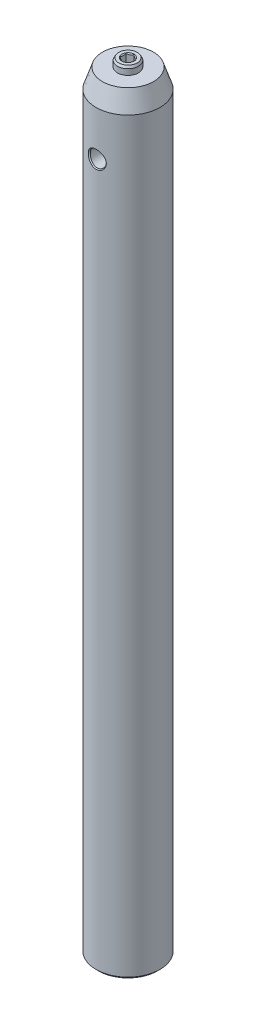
ISO-10303-21;
HEADER;
FILE_DESCRIPTION(('STEP AP214'),'2;1');
FILE_NAME('part.step','',(''),(''),'','','');
FILE_SCHEMA(('AUTOMOTIVE_DESIGN { 1 0 10303 214 1 1 1 1 }'));
ENDSEC;
DATA;
#1=APPLICATION_CONTEXT('core data for automotive mechanical design processes');
#2=APPLICATION_PROTOCOL_DEFINITION('international standard','automotive_design',2000,#1);
#3=PRODUCT_CONTEXT('',#1,'mechanical');
#4=PRODUCT('Part','Part','',(#3));
#5=PRODUCT_RELATED_PRODUCT_CATEGORY('part','',(#4));
#6=PRODUCT_DEFINITION_FORMATION('','',#4);
#7=PRODUCT_DEFINITION_CONTEXT('part definition',#1,'design');
#8=PRODUCT_DEFINITION('design','',#6,#7);
#9=PRODUCT_DEFINITION_SHAPE('','',#8);
#10=(LENGTH_UNIT() NAMED_UNIT(*) SI_UNIT(.MILLI.,.METRE.));
#11=(NAMED_UNIT(*) PLANE_ANGLE_UNIT() SI_UNIT($,.RADIAN.));
#12=(NAMED_UNIT(*) SI_UNIT($,.STERADIAN.) SOLID_ANGLE_UNIT());
#13=UNCERTAINTY_MEASURE_WITH_UNIT(LENGTH_MEASURE(1.E-05),#10,'distance_accuracy_value','');
#14=(GEOMETRIC_REPRESENTATION_CONTEXT(3) GLOBAL_UNCERTAINTY_ASSIGNED_CONTEXT((#13)) GLOBAL_UNIT_ASSIGNED_CONTEXT((#10,
#11,#12)) REPRESENTATION_CONTEXT('',''));
#15=CARTESIAN_POINT('',(0.,0.,0.));
#16=DIRECTION('',(0.,0.,1.));
#17=DIRECTION('',(1.,0.,0.));
#18=AXIS2_PLACEMENT_3D('',#15,#16,#17);
#19=CARTESIAN_POINT('',(-1.583787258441,153.9875,-0.914400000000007));
#20=DIRECTION('',(0.,-1.,0.));
#21=DIRECTION('',(-0.5,0.,0.866025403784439));
#22=AXIS2_PLACEMENT_3D('',#19,#20,#21);
#23=PLANE('',#22);
#24=CARTESIAN_POINT('',(0.,153.9875,0.));
#25=DIRECTION('',(0.,-1.,0.));
#26=DIRECTION('',(0.866025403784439,0.,0.5));
#27=AXIS2_PLACEMENT_3D('',#24,#25,#26);
#28=CIRCLE('',#27,1.2065);
#29=CARTESIAN_POINT('',(1.04485964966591,153.9875,0.603249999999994));
#30=VERTEX_POINT('',#29);
#31=EDGE_CURVE('P0_E524',#30,#30,#28,.T.);
#32=ORIENTED_EDGE('',*,*,#31,.T.);
#33=EDGE_LOOP('',(#32));
#34=FACE_BOUND('',#33,.T.);
#35=CARTESIAN_POINT('',(0.,153.9875,0.));
#36=DIRECTION('',(0.,-1.,0.));
#37=DIRECTION('',(-0.5,0.,0.866025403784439));
#38=AXIS2_PLACEMENT_3D('',#35,#36,#37);
#39=CIRCLE('',#38,1.8288);
#40=CARTESIAN_POINT('',(-0.914400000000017,153.9875,1.58378725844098));
#41=VERTEX_POINT('',#40);
#42=EDGE_CURVE('P0_E167',#41,#41,#39,.T.);
#43=ORIENTED_EDGE('',*,*,#42,.F.);
#44=EDGE_LOOP('',(#43));
#45=FACE_BOUND('',#44,.T.);
#46=ADVANCED_FACE('P0_F16',(#34,#45),#23,.F.);
#47=CARTESIAN_POINT('',(0.,141.2875,0.));
#48=DIRECTION('',(0.,1.,0.));
#49=DIRECTION('',(0.5,0.,-0.866025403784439));
#50=AXIS2_PLACEMENT_3D('',#47,#48,#49);
#51=PLANE('',#50);
#52=CARTESIAN_POINT('',(0.,141.2875,0.));
#53=DIRECTION('',(0.,-1.,0.));
#54=DIRECTION('',(0.866025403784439,0.,0.5));
#55=AXIS2_PLACEMENT_3D('',#52,#53,#54);
#56=CIRCLE('',#55,1.20649999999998);
#57=CARTESIAN_POINT('',(1.04485964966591,141.2875,0.603249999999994));
#58=VERTEX_POINT('',#57);
#59=EDGE_CURVE('P0_E130',#58,#58,#56,.T.);
#60=ORIENTED_EDGE('',*,*,#59,.F.);
#61=EDGE_LOOP('',(#60));
#62=FACE_BOUND('',#61,.T.);
#63=CARTESIAN_POINT('',(0.,141.2875,0.));
#64=DIRECTION('',(0.,-1.,0.));
#65=DIRECTION('',(-0.5,0.,0.866025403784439));
#66=AXIS2_PLACEMENT_3D('',#63,#64,#65);
#67=CIRCLE('',#66,1.8288);
#68=CARTESIAN_POINT('',(-0.914400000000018,141.2875,1.58378725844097));
#69=VERTEX_POINT('',#68);
#70=EDGE_CURVE('P0_E190',#69,#69,#67,.T.);
#71=ORIENTED_EDGE('',*,*,#70,.T.);
#72=EDGE_LOOP('',(#71));
#73=FACE_BOUND('',#72,.T.);
#74=ADVANCED_FACE('P0_F18',(#62,#73),#51,.F.);
#75=CARTESIAN_POINT('',(0.,141.727440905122,0.));
#76=DIRECTION('',(0.,1.,0.));
#77=DIRECTION('',(0.5,0.,-0.866025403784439));
#78=AXIS2_PLACEMENT_3D('',#75,#76,#77);
#79=CONICAL_SURFACE('',#78,2.0828,0.523598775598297);
#80=ORIENTED_EDGE('',*,*,#70,.F.);
#81=EDGE_LOOP('',(#80));
#82=FACE_BOUND('',#81,.T.);
#83=CARTESIAN_POINT('',(0.,141.727440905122,0.));
#84=DIRECTION('',(0.,-1.,0.));
#85=DIRECTION('',(-0.5,0.,0.866025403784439));
#86=AXIS2_PLACEMENT_3D('',#83,#84,#85);
#87=CIRCLE('',#86,2.0828);
#88=CARTESIAN_POINT('',(-1.04140000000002,141.727440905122,1.80375771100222));
#89=VERTEX_POINT('',#88);
#90=EDGE_CURVE('P0_E187',#89,#89,#87,.T.);
#91=ORIENTED_EDGE('',*,*,#90,.T.);
#92=EDGE_LOOP('',(#91));
#93=FACE_BOUND('',#92,.T.);
#94=ADVANCED_FACE('P0_F277',(#82,#93),#79,.T.);
#95=CARTESIAN_POINT('',(0.,141.2875,0.));
#96=DIRECTION('',(0.,-1.,0.));
#97=DIRECTION('',(-0.5,0.,0.866025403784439));
#98=AXIS2_PLACEMENT_3D('',#95,#96,#97);
#99=CYLINDRICAL_SURFACE('',#98,2.0828);
#100=ORIENTED_EDGE('',*,*,#90,.F.);
#101=EDGE_LOOP('',(#100));
#102=FACE_BOUND('',#101,.T.);
#103=CARTESIAN_POINT('',(0.,153.547559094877,0.));
#104=DIRECTION('',(0.,-1.,0.));
#105=DIRECTION('',(-0.5,0.,0.866025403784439));
#106=AXIS2_PLACEMENT_3D('',#103,#104,#105);
#107=CIRCLE('',#106,2.0828);
#108=CARTESIAN_POINT('',(-1.04140000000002,153.547559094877,1.80375771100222));
#109=VERTEX_POINT('',#108);
#110=EDGE_CURVE('P0_E184',#109,#109,#107,.T.);
#111=ORIENTED_EDGE('',*,*,#110,.T.);
#112=EDGE_LOOP('',(#111));
#113=FACE_BOUND('',#112,.T.);
#114=ADVANCED_FACE('P0_F285',(#102,#113),#99,.T.);
#115=CARTESIAN_POINT('',(0.,153.9875,0.));
#116=DIRECTION('',(0.,-1.,0.));
#117=DIRECTION('',(-0.5,0.,0.866025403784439));
#118=AXIS2_PLACEMENT_3D('',#115,#116,#117);
#119=CONICAL_SURFACE('',#118,1.8288,0.523598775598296);
#120=ORIENTED_EDGE('',*,*,#110,.F.);
#121=EDGE_LOOP('',(#120));
#122=FACE_BOUND('',#121,.T.);
#123=ORIENTED_EDGE('',*,*,#42,.T.);
#124=EDGE_LOOP('',(#123));
#125=FACE_BOUND('',#124,.T.);
#126=ADVANCED_FACE('P0_F206',(#122,#125),#119,.T.);
#127=CARTESIAN_POINT('',(0.,141.2875,0.));
#128=DIRECTION('',(0.,-1.,0.));
#129=DIRECTION('',(0.866025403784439,0.,0.5));
#130=AXIS2_PLACEMENT_3D('',#127,#128,#129);
#131=CONICAL_SURFACE('',#130,1.20649999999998,0.785398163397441);
#132=ORIENTED_EDGE('',*,*,#59,.T.);
#133=EDGE_LOOP('',(#132));
#134=FACE_BOUND('',#133,.T.);
#135=CARTESIAN_POINT('',(0.527703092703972,140.938568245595,1.46318057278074));
#136=CARTESIAN_POINT('',(0.502764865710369,140.960569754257,1.44878248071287));
#137=CARTESIAN_POINT('',(0.477690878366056,140.982365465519,1.43430600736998));
#138=CARTESIAN_POINT('',(0.427215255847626,141.025459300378,1.40516389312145));
#139=CARTESIAN_POINT('',(0.401813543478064,141.046757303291,1.390498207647));
#140=CARTESIAN_POINT('',(0.324660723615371,141.110079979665,1.34595400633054));
#141=CARTESIAN_POINT('',(0.272340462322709,141.151195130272,1.31574688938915));
#142=CARTESIAN_POINT('',(0.162436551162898,141.232221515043,1.25229383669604));
#143=CARTESIAN_POINT('',(0.10472647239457,141.271906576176,1.21897490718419));
#144=CARTESIAN_POINT('',(-0.0136118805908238,141.344715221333,1.15065222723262));
#145=CARTESIAN_POINT('',(-0.0742294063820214,141.377860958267,1.11565468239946));
#146=CARTESIAN_POINT('',(-0.164944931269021,141.4184212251,1.06328004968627));
#147=CARTESIAN_POINT('',(-0.193638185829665,141.430004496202,1.04671399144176));
#148=CARTESIAN_POINT('',(-0.251742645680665,141.450514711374,1.01316736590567));
#149=CARTESIAN_POINT('',(-0.281153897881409,141.459441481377,0.996186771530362));
#150=CARTESIAN_POINT('',(-0.340008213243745,141.474015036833,0.962207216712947));
#151=CARTESIAN_POINT('',(-0.369440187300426,141.479720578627,0.94521465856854));
#152=CARTESIAN_POINT('',(-0.428660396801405,141.48773841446,0.911023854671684));
#153=CARTESIAN_POINT('',(-0.458448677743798,141.490050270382,0.893825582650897));
#154=CARTESIAN_POINT('',(-0.516857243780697,141.491089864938,0.860103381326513));
#155=CARTESIAN_POINT('',(-0.545475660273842,141.489959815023,0.843580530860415));
#156=CARTESIAN_POINT('',(-0.602471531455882,141.484500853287,0.810673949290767));
#157=CARTESIAN_POINT('',(-0.630849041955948,141.48017270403,0.794290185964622));
#158=CARTESIAN_POINT('',(-0.687653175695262,141.468485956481,0.761494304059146));
#159=CARTESIAN_POINT('',(-0.716071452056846,141.461074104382,0.74508700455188));
#160=CARTESIAN_POINT('',(-0.772283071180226,141.443623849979,0.712633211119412));
#161=CARTESIAN_POINT('',(-0.800076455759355,141.433585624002,0.696586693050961));
#162=CARTESIAN_POINT('',(-0.886310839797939,141.398624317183,0.646799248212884));
#163=CARTESIAN_POINT('',(-0.943556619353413,141.369781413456,0.61374838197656));
#164=CARTESIAN_POINT('',(-1.05536939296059,141.30561435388,0.549193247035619));
#165=CARTESIAN_POINT('',(-1.10992598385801,141.270267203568,0.517694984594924));
#166=CARTESIAN_POINT('',(-1.21420791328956,141.197301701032,0.457487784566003));
#167=CARTESIAN_POINT('',(-1.26403876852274,141.159881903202,0.42871792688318));
#168=CARTESIAN_POINT('',(-1.33745408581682,141.102016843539,0.3863315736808));
#169=CARTESIAN_POINT('',(-1.36160967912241,141.082520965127,0.372385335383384));
#170=CARTESIAN_POINT('',(-1.40958992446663,141.043008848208,0.344683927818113));
#171=CARTESIAN_POINT('',(-1.43341466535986,141.022992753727,0.330928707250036));
#172=CARTESIAN_POINT('',(-1.45710149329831,141.002760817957,0.317253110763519));
#173=B_SPLINE_CURVE_WITH_KNOTS('',3,(#135,#136,#137,#138,#139,#140,#141,#142,#143,#144,#145,
#146,#147,#148,#149,#150,#151,#152,#153,#154,#155,#156,#157,#158,#159,#160,#161,#162,#163,#164,
#165,#166,#167,#168,#169,#170,#171,#172),.UNSPECIFIED.,.F.,.F.,(4,2,2,2,2,2,2,2,2,2,2,2,2,2,2,2,
2,2,4),(0.,0.108715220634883,0.217456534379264,0.436596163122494,0.669094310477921,
0.900790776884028,1.00599817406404,1.11121246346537,1.21443987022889,1.31768060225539,
1.41671434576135,1.5157244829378,1.61652052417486,1.71730980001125,1.93303955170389,
2.14954716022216,2.35535564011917,2.45744337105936,2.55950313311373),.UNSPECIFIED.);
#174=CARTESIAN_POINT('',(0.,141.335488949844,1.1585110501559));
#175=VERTEX_POINT('',#174);
#176=CARTESIAN_POINT('',(-1.00330000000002,141.335488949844,0.579255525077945));
#177=VERTEX_POINT('',#176);
#178=EDGE_CURVE('P0_E235',#175,#177,#173,.T.);
#179=ORIENTED_EDGE('',*,*,#178,.F.);
#180=CARTESIAN_POINT('',(1.00349999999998,141.335373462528,0.579140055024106));
#181=CARTESIAN_POINT('',(0.96900398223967,141.355276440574,0.599056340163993));
#182=CARTESIAN_POINT('',(0.933931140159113,141.374010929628,0.619305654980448));
#183=CARTESIAN_POINT('',(0.862413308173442,141.408313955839,0.660596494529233));
#184=CARTESIAN_POINT('',(0.825961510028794,141.423863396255,0.681641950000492));
#185=CARTESIAN_POINT('',(0.752457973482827,141.450500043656,0.724079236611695));
#186=CARTESIAN_POINT('',(0.71542497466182,141.461654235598,0.745460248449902));
#187=CARTESIAN_POINT('',(0.6405438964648,141.478840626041,0.788692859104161));
#188=CARTESIAN_POINT('',(0.602698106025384,141.484885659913,0.810543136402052));
#189=CARTESIAN_POINT('',(0.537475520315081,141.49033772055,0.848199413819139));
#190=CARTESIAN_POINT('',(0.510183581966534,141.491143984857,0.86395642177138));
#191=CARTESIAN_POINT('',(0.455652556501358,141.489789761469,0.895439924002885));
#192=CARTESIAN_POINT('',(0.428413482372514,141.48762861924,0.911166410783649));
#193=CARTESIAN_POINT('',(0.34708523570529,141.476836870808,0.958121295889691));
#194=CARTESIAN_POINT('',(0.293400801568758,141.463896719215,0.989116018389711));
#195=CARTESIAN_POINT('',(0.199179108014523,141.43266786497,1.04351493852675));
#196=CARTESIAN_POINT('',(0.158199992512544,141.416016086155,1.06717424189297));
#197=CARTESIAN_POINT('',(0.0778468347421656,141.378505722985,1.11356615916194));
#198=CARTESIAN_POINT('',(0.0384680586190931,141.357660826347,1.13630150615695));
#199=CARTESIAN_POINT('',(-0.000200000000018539,141.335373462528,1.15862652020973));
#200=B_SPLINE_CURVE_WITH_KNOTS('',3,(#180,#181,#182,#183,#184,#185,#186,#187,#188,#189,#190,
#191,#192,#193,#194,#195,#196,#197,#198,#199),.UNSPECIFIED.,.F.,.F.,(4,2,2,2,2,2,2,2,2,4),(0.,
0.133677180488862,0.268133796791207,0.40045368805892,0.532440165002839,0.626876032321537,
0.721332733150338,0.910299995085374,1.06058821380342,1.2103935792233),.UNSPECIFIED.);
#201=CARTESIAN_POINT('',(1.00329999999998,141.335488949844,0.579255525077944));
#202=VERTEX_POINT('',#201);
#203=EDGE_CURVE('P0_E229',#202,#175,#200,.T.);
#204=ORIENTED_EDGE('',*,*,#203,.F.);
#205=CARTESIAN_POINT('',(1.00329999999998,141.335373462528,-0.579486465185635));
#206=CARTESIAN_POINT('',(1.00329999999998,141.355276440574,-0.53965389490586));
#207=CARTESIAN_POINT('',(1.00329999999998,141.374010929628,-0.499155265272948));
#208=CARTESIAN_POINT('',(1.00329999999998,141.408313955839,-0.416573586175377));
#209=CARTESIAN_POINT('',(1.00329999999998,141.423863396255,-0.374482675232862));
#210=CARTESIAN_POINT('',(1.00329999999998,141.450500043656,-0.289608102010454));
#211=CARTESIAN_POINT('',(1.00329999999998,141.461654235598,-0.246846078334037));
#212=CARTESIAN_POINT('',(1.00329999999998,141.478840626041,-0.160380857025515));
#213=CARTESIAN_POINT('',(1.00329999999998,141.484885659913,-0.116680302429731));
#214=CARTESIAN_POINT('',(1.00329999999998,141.49033772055,-0.0413677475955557));
#215=CARTESIAN_POINT('',(1.00329999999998,141.491143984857,-0.00985373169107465));
#216=CARTESIAN_POINT('',(1.00329999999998,141.489789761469,0.0531132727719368));
#217=CARTESIAN_POINT('',(1.00329999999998,141.48762861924,0.0845662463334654));
#218=CARTESIAN_POINT('',(1.00329999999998,141.476836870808,0.17847601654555));
#219=CARTESIAN_POINT('',(1.00329999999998,141.463896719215,0.240465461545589));
#220=CARTESIAN_POINT('',(1.00329999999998,141.43266786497,0.34926330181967));
#221=CARTESIAN_POINT('',(1.00329999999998,141.416016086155,0.396581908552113));
#222=CARTESIAN_POINT('',(1.00329999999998,141.378505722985,0.489365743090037));
#223=CARTESIAN_POINT('',(1.00329999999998,141.357660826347,0.534836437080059));
#224=CARTESIAN_POINT('',(1.00329999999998,141.335373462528,0.57948646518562));
#225=B_SPLINE_CURVE_WITH_KNOTS('',3,(#205,#206,#207,#208,#209,#210,#211,#212,#213,#214,#215,
#216,#217,#218,#219,#220,#221,#222,#223,#224),.UNSPECIFIED.,.F.,.F.,(4,2,2,2,2,2,2,2,2,4),(0.,
0.133677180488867,0.268133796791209,0.400453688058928,0.532440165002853,0.62687603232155,
0.721332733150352,0.910299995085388,1.06058821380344,1.2103935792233),.UNSPECIFIED.);
#226=CARTESIAN_POINT('',(1.00329999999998,141.335488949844,-0.579255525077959));
#227=VERTEX_POINT('',#226);
#228=EDGE_CURVE('P0_E223',#227,#202,#225,.T.);
#229=ORIENTED_EDGE('',*,*,#228,.F.);
#230=CARTESIAN_POINT('',(1.53100309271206,140.938568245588,-0.274586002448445));
#231=CARTESIAN_POINT('',(1.50606486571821,140.96056975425,-0.288984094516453));
#232=CARTESIAN_POINT('',(1.48099087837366,140.982365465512,-0.303460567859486));
#233=CARTESIAN_POINT('',(1.43051525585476,141.025459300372,-0.332602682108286));
#234=CARTESIAN_POINT('',(1.40511354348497,141.046757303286,-0.347268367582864));
#235=CARTESIAN_POINT('',(1.32796072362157,141.11007997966,-0.391812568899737));
#236=CARTESIAN_POINT('',(1.27564046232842,141.151195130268,-0.422019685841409));
#237=CARTESIAN_POINT('',(1.16573655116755,141.23222151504,-0.485472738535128));
#238=CARTESIAN_POINT('',(1.10802647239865,141.271906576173,-0.518791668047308));
#239=CARTESIAN_POINT('',(0.989688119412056,141.344715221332,-0.587114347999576));
#240=CARTESIAN_POINT('',(0.929070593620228,141.377860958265,-0.622111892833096));
#241=CARTESIAN_POINT('',(0.838355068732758,141.4184212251,-0.674486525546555));
#242=CARTESIAN_POINT('',(0.809661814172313,141.430004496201,-0.691052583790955));
#243=CARTESIAN_POINT('',(0.751557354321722,141.450514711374,-0.724599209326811));
#244=CARTESIAN_POINT('',(0.722146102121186,141.459441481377,-0.741579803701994));
#245=CARTESIAN_POINT('',(0.663291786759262,141.474015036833,-0.775559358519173));
#246=CARTESIAN_POINT('',(0.633859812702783,141.479720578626,-0.792551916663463));
#247=CARTESIAN_POINT('',(0.574639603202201,141.48773841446,-0.82674272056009));
#248=CARTESIAN_POINT('',(0.544851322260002,141.490050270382,-0.843940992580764));
#249=CARTESIAN_POINT('',(0.486442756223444,141.491089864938,-0.877663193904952));
#250=CARTESIAN_POINT('',(0.457824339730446,141.489959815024,-0.894186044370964));
#251=CARTESIAN_POINT('',(0.400828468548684,141.484500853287,-0.927092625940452));
#252=CARTESIAN_POINT('',(0.37245095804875,141.48017270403,-0.943476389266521));
#253=CARTESIAN_POINT('',(0.315646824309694,141.468485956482,-0.976272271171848));
#254=CARTESIAN_POINT('',(0.287228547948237,141.461074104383,-0.99267957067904));
#255=CARTESIAN_POINT('',(0.231016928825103,141.443623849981,-1.02513336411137));
#256=CARTESIAN_POINT('',(0.203223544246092,141.433585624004,-1.04117988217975));
#257=CARTESIAN_POINT('',(0.116989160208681,141.398624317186,-1.09096732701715));
#258=CARTESIAN_POINT('',(0.0597433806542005,141.36978141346,-1.1240181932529));
#259=CARTESIAN_POINT('',(-0.0520693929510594,141.305614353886,-1.18857332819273));
#260=CARTESIAN_POINT('',(-0.10662598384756,141.270267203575,-1.2200715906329));
#261=CARTESIAN_POINT('',(-0.21090791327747,141.197301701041,-1.28027879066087));
#262=CARTESIAN_POINT('',(-0.260738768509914,141.159881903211,-1.30904864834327));
#263=CARTESIAN_POINT('',(-0.334154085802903,141.10201684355,-1.35143500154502));
#264=CARTESIAN_POINT('',(-0.358309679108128,141.082520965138,-1.36538123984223));
#265=CARTESIAN_POINT('',(-0.406289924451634,141.04300884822,-1.39308264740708));
#266=CARTESIAN_POINT('',(-0.430114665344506,141.02299275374,-1.40683786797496));
#267=CARTESIAN_POINT('',(-0.453801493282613,141.00276081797,-1.42051346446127));
#268=B_SPLINE_CURVE_WITH_KNOTS('',3,(#230,#231,#232,#233,#234,#235,#236,#237,#238,#239,#240,
#241,#242,#243,#244,#245,#246,#247,#248,#249,#250,#251,#252,#253,#254,#255,#256,#257,#258,#259,
#260,#261,#262,#263,#264,#265,#266,#267),.UNSPECIFIED.,.F.,.F.,(4,2,2,2,2,2,2,2,2,2,2,2,2,2,2,2,
2,2,4),(0.,0.108715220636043,0.217456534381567,0.436596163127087,0.669094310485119,
0.900790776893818,1.00599817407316,1.11121246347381,1.21443987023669,1.31768060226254,
1.41671434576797,1.5157244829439,1.61652052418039,1.7173098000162,1.9330395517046,
2.1495471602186,2.35535564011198,2.45744337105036,2.55950313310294),.UNSPECIFIED.);
#269=CARTESIAN_POINT('',(0.,141.335488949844,-1.15851105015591));
#270=VERTEX_POINT('',#269);
#271=EDGE_CURVE('P0_E43',#270,#227,#268,.F.);
#272=ORIENTED_EDGE('',*,*,#271,.F.);
#273=CARTESIAN_POINT('',(-1.00350000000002,141.335373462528,-0.579140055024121));
#274=CARTESIAN_POINT('',(-0.969003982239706,141.355276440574,-0.599056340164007));
#275=CARTESIAN_POINT('',(-0.933931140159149,141.374010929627,-0.619305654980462));
#276=CARTESIAN_POINT('',(-0.862413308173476,141.408313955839,-0.660596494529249));
#277=CARTESIAN_POINT('',(-0.825961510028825,141.423863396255,-0.681641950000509));
#278=CARTESIAN_POINT('',(-0.752457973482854,141.450500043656,-0.724079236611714));
#279=CARTESIAN_POINT('',(-0.715424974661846,141.461654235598,-0.745460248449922));
#280=CARTESIAN_POINT('',(-0.640543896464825,141.47884062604,-0.788692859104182));
#281=CARTESIAN_POINT('',(-0.60269810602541,141.484885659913,-0.810543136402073));
#282=CARTESIAN_POINT('',(-0.537475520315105,141.49033772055,-0.848199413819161));
#283=CARTESIAN_POINT('',(-0.510183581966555,141.491143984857,-0.863956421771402));
#284=CARTESIAN_POINT('',(-0.455652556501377,141.489789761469,-0.895439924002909));
#285=CARTESIAN_POINT('',(-0.428413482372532,141.48762861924,-0.911166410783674));
#286=CARTESIAN_POINT('',(-0.347085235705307,141.476836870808,-0.958121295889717));
#287=CARTESIAN_POINT('',(-0.293400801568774,141.463896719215,-0.989116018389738));
#288=CARTESIAN_POINT('',(-0.199179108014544,141.43266786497,-1.04351493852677));
#289=CARTESIAN_POINT('',(-0.158199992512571,141.416016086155,-1.06717424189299));
#290=CARTESIAN_POINT('',(-0.0778468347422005,141.378505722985,-1.11356615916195));
#291=CARTESIAN_POINT('',(-0.0384680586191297,141.357660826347,-1.13630150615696));
#292=CARTESIAN_POINT('',(0.000199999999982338,141.335373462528,-1.15862652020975));
#293=B_SPLINE_CURVE_WITH_KNOTS('',3,(#273,#274,#275,#276,#277,#278,#279,#280,#281,#282,#283,
#284,#285,#286,#287,#288,#289,#290,#291,#292),.UNSPECIFIED.,.F.,.F.,(4,2,2,2,2,2,2,2,2,4),(0.,
0.133677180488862,0.268133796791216,0.400453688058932,0.532440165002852,0.626876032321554,
0.721332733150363,0.910299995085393,1.06058821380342,1.21039357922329),.UNSPECIFIED.);
#294=CARTESIAN_POINT('',(-1.00330000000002,141.335488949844,-0.579255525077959));
#295=VERTEX_POINT('',#294);
#296=EDGE_CURVE('P0_E29',#295,#270,#293,.T.);
#297=ORIENTED_EDGE('',*,*,#296,.F.);
#298=CARTESIAN_POINT('',(-1.00330000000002,141.335373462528,0.57948646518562));
#299=CARTESIAN_POINT('',(-1.00330000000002,141.355276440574,0.539653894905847));
#300=CARTESIAN_POINT('',(-1.00330000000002,141.374010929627,0.499155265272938));
#301=CARTESIAN_POINT('',(-1.00330000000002,141.408313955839,0.416573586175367));
#302=CARTESIAN_POINT('',(-1.00330000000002,141.423863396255,0.37448267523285));
#303=CARTESIAN_POINT('',(-1.00330000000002,141.450500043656,0.289608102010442));
#304=CARTESIAN_POINT('',(-1.00330000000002,141.461654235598,0.246846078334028));
#305=CARTESIAN_POINT('',(-1.00330000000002,141.47884062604,0.16038085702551));
#306=CARTESIAN_POINT('',(-1.00330000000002,141.484885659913,0.116680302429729));
#307=CARTESIAN_POINT('',(-1.00330000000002,141.49033772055,0.0413677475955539));
#308=CARTESIAN_POINT('',(-1.00330000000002,141.491143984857,0.00985373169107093));
#309=CARTESIAN_POINT('',(-1.00330000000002,141.489789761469,-0.0531132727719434));
#310=CARTESIAN_POINT('',(-1.00330000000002,141.48762861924,-0.0845662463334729));
#311=CARTESIAN_POINT('',(-1.00330000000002,141.476836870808,-0.178476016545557));
#312=CARTESIAN_POINT('',(-1.00330000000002,141.463896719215,-0.240465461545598));
#313=CARTESIAN_POINT('',(-1.00330000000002,141.43266786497,-0.349263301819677));
#314=CARTESIAN_POINT('',(-1.00330000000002,141.416016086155,-0.396581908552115));
#315=CARTESIAN_POINT('',(-1.00330000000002,141.378505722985,-0.48936574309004));
#316=CARTESIAN_POINT('',(-1.00330000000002,141.357660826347,-0.534836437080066));
#317=CARTESIAN_POINT('',(-1.00330000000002,141.335373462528,-0.579486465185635));
#318=B_SPLINE_CURVE_WITH_KNOTS('',3,(#298,#299,#300,#301,#302,#303,#304,#305,#306,#307,#308,
#309,#310,#311,#312,#313,#314,#315,#316,#317),.UNSPECIFIED.,.F.,.F.,(4,2,2,2,2,2,2,2,2,4),(0.,
0.133677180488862,0.268133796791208,0.400453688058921,0.532440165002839,0.626876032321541,
0.72133273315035,0.910299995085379,1.06058821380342,1.21039357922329),.UNSPECIFIED.);
#319=EDGE_CURVE('P0_E241',#177,#295,#318,.T.);
#320=ORIENTED_EDGE('',*,*,#319,.F.);
#321=EDGE_LOOP('',(#179,#204,#229,#272,#297,#320));
#322=FACE_BOUND('',#321,.T.);
#323=ADVANCED_FACE('P0_F201',(#134,#322),#131,.F.);
#324=CARTESIAN_POINT('',(0.,144.0815,0.));
#325=DIRECTION('',(0.,-1.,0.));
#326=DIRECTION('',(-0.5,0.,0.866025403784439));
#327=AXIS2_PLACEMENT_3D('',#324,#325,#326);
#328=CONICAL_SURFACE('',#327,0.992251,1.02974425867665);
#329=CARTESIAN_POINT('',(0.,144.677704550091,0.));
#330=VERTEX_POINT('',#329);
#331=VERTEX_LOOP('',#330);
#332=FACE_BOUND('',#331,.T.);
#333=CARTESIAN_POINT('',(0.,144.0815,0.));
#334=DIRECTION('',(0.,-1.,0.));
#335=DIRECTION('',(-0.5,0.,0.866025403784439));
#336=AXIS2_PLACEMENT_3D('',#333,#334,#335);
#337=CIRCLE('',#336,0.992251);
#338=CARTESIAN_POINT('',(-0.496125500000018,144.0815,0.859314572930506));
#339=VERTEX_POINT('',#338);
#340=EDGE_CURVE('P0_E476',#339,#339,#337,.T.);
#341=ORIENTED_EDGE('',*,*,#340,.T.);
#342=EDGE_LOOP('',(#341));
#343=FACE_BOUND('',#342,.T.);
#344=ADVANCED_FACE('P0_F205',(#332,#343),#328,.F.);
#345=CARTESIAN_POINT('',(-1.00330000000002,144.0815,-1.73776657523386));
#346=DIRECTION('',(0.,-1.,0.));
#347=DIRECTION('',(-0.5,0.,0.866025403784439));
#348=AXIS2_PLACEMENT_3D('',#345,#346,#347);
#349=PLANE('',#348);
#350=ORIENTED_EDGE('',*,*,#340,.F.);
#351=EDGE_LOOP('',(#350));
#352=FACE_BOUND('',#351,.T.);
#353=DIRECTION('',(0.,0.,-1.));
#354=VECTOR('',#353,1.);
#355=CARTESIAN_POINT('',(-1.00330000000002,144.0815,0.579255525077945));
#356=LINE('',#355,#354);
#357=CARTESIAN_POINT('',(-1.00330000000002,144.0815,0.579255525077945));
#358=VERTEX_POINT('',#357);
#359=CARTESIAN_POINT('',(-1.00330000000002,144.0815,-0.579255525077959));
#360=VERTEX_POINT('',#359);
#361=EDGE_CURVE('P0_E145',#358,#360,#356,.T.);
#362=ORIENTED_EDGE('',*,*,#361,.T.);
#363=DIRECTION('',(0.866025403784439,0.,-0.5));
#364=VECTOR('',#363,1.);
#365=CARTESIAN_POINT('',(-1.00330000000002,144.0815,-0.579255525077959));
#366=LINE('',#365,#364);
#367=CARTESIAN_POINT('',(0.,144.0815,-1.15851105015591));
#368=VERTEX_POINT('',#367);
#369=EDGE_CURVE('P0_E148',#360,#368,#366,.T.);
#370=ORIENTED_EDGE('',*,*,#369,.T.);
#371=DIRECTION('',(0.866025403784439,0.,0.5));
#372=VECTOR('',#371,1.);
#373=CARTESIAN_POINT('',(0.,144.0815,-1.15851105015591));
#374=LINE('',#373,#372);
#375=CARTESIAN_POINT('',(1.00329999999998,144.0815,-0.579255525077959));
#376=VERTEX_POINT('',#375);
#377=EDGE_CURVE('P0_E151',#368,#376,#374,.T.);
#378=ORIENTED_EDGE('',*,*,#377,.T.);
#379=DIRECTION('',(0.,0.,1.));
#380=VECTOR('',#379,1.);
#381=CARTESIAN_POINT('',(1.00329999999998,144.0815,-0.579255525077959));
#382=LINE('',#381,#380);
#383=CARTESIAN_POINT('',(1.00329999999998,144.0815,0.579255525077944));
#384=VERTEX_POINT('',#383);
#385=EDGE_CURVE('P0_E154',#376,#384,#382,.T.);
#386=ORIENTED_EDGE('',*,*,#385,.T.);
#387=DIRECTION('',(-0.866025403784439,0.,0.5));
#388=VECTOR('',#387,1.);
#389=CARTESIAN_POINT('',(1.00329999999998,144.0815,0.579255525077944));
#390=LINE('',#389,#388);
#391=CARTESIAN_POINT('',(0.,144.0815,1.1585110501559));
#392=VERTEX_POINT('',#391);
#393=EDGE_CURVE('P0_E157',#384,#392,#390,.T.);
#394=ORIENTED_EDGE('',*,*,#393,.T.);
#395=DIRECTION('',(-0.866025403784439,0.,-0.5));
#396=VECTOR('',#395,1.);
#397=CARTESIAN_POINT('',(0.,144.0815,1.1585110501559));
#398=LINE('',#397,#396);
#399=EDGE_CURVE('P0_E160',#392,#358,#398,.T.);
#400=ORIENTED_EDGE('',*,*,#399,.T.);
#401=EDGE_LOOP('',(#362,#370,#378,#386,#394,#400));
#402=FACE_BOUND('',#401,.T.);
#403=ADVANCED_FACE('P0_F253',(#352,#402),#349,.T.);
#404=CARTESIAN_POINT('',(-1.00330000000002,144.0815,-0.579255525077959));
#405=DIRECTION('',(-0.5,0.,-0.866025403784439));
#406=DIRECTION('',(0.866025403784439,0.,-0.5));
#407=AXIS2_PLACEMENT_3D('',#404,#405,#406);
#408=PLANE('',#407);
#409=DIRECTION('',(0.,-1.,0.));
#410=VECTOR('',#409,1.);
#411=CARTESIAN_POINT('',(-1.00330000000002,144.0815,-0.579255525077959));
#412=LINE('',#411,#410);
#413=EDGE_CURVE('P0_E163',#360,#295,#412,.T.);
#414=ORIENTED_EDGE('',*,*,#413,.T.);
#415=ORIENTED_EDGE('',*,*,#296,.T.);
#416=DIRECTION('',(0.,-1.,0.));
#417=VECTOR('',#416,1.);
#418=CARTESIAN_POINT('',(0.,144.0815,-1.15851105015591));
#419=LINE('',#418,#417);
#420=EDGE_CURVE('P0_E177',#368,#270,#419,.T.);
#421=ORIENTED_EDGE('',*,*,#420,.F.);
#422=ORIENTED_EDGE('',*,*,#369,.F.);
#423=EDGE_LOOP('',(#414,#415,#421,#422));
#424=FACE_BOUND('',#423,.T.);
#425=ADVANCED_FACE('P0_F197',(#424),#408,.F.);
#426=CARTESIAN_POINT('',(0.,144.0815,-1.15851105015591));
#427=DIRECTION('',(0.5,0.,-0.866025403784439));
#428=DIRECTION('',(0.866025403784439,0.,0.5));
#429=AXIS2_PLACEMENT_3D('',#426,#427,#428);
#430=PLANE('',#429);
#431=ORIENTED_EDGE('',*,*,#420,.T.);
#432=ORIENTED_EDGE('',*,*,#271,.T.);
#433=DIRECTION('',(0.,-1.,0.));
#434=VECTOR('',#433,1.);
#435=CARTESIAN_POINT('',(1.00329999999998,144.0815,-0.579255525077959));
#436=LINE('',#435,#434);
#437=EDGE_CURVE('P0_E174',#376,#227,#436,.T.);
#438=ORIENTED_EDGE('',*,*,#437,.F.);
#439=ORIENTED_EDGE('',*,*,#377,.F.);
#440=EDGE_LOOP('',(#431,#432,#438,#439));
#441=FACE_BOUND('',#440,.T.);
#442=ADVANCED_FACE('P0_F261',(#441),#430,.F.);
#443=CARTESIAN_POINT('',(1.00329999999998,144.0815,-0.579255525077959));
#444=DIRECTION('',(1.,0.,0.));
#445=DIRECTION('',(0.,0.,1.));
#446=AXIS2_PLACEMENT_3D('',#443,#444,#445);
#447=PLANE('',#446);
#448=ORIENTED_EDGE('',*,*,#437,.T.);
#449=ORIENTED_EDGE('',*,*,#228,.T.);
#450=DIRECTION('',(0.,-1.,0.));
#451=VECTOR('',#450,1.);
#452=CARTESIAN_POINT('',(1.00329999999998,144.0815,0.579255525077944));
#453=LINE('',#452,#451);
#454=EDGE_CURVE('P0_E171',#384,#202,#453,.T.);
#455=ORIENTED_EDGE('',*,*,#454,.F.);
#456=ORIENTED_EDGE('',*,*,#385,.F.);
#457=EDGE_LOOP('',(#448,#449,#455,#456));
#458=FACE_BOUND('',#457,.T.);
#459=ADVANCED_FACE('P0_F257',(#458),#447,.F.);
#460=CARTESIAN_POINT('',(1.00329999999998,144.0815,0.579255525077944));
#461=DIRECTION('',(0.5,0.,0.866025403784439));
#462=DIRECTION('',(-0.866025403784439,0.,0.5));
#463=AXIS2_PLACEMENT_3D('',#460,#461,#462);
#464=PLANE('',#463);
#465=ORIENTED_EDGE('',*,*,#454,.T.);
#466=ORIENTED_EDGE('',*,*,#203,.T.);
#467=DIRECTION('',(0.,-1.,0.));
#468=VECTOR('',#467,1.);
#469=CARTESIAN_POINT('',(0.,144.0815,1.1585110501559));
#470=LINE('',#469,#468);
#471=EDGE_CURVE('P0_E168',#392,#175,#470,.T.);
#472=ORIENTED_EDGE('',*,*,#471,.F.);
#473=ORIENTED_EDGE('',*,*,#393,.F.);
#474=EDGE_LOOP('',(#465,#466,#472,#473));
#475=FACE_BOUND('',#474,.T.);
#476=ADVANCED_FACE('P0_F251',(#475),#464,.F.);
#477=CARTESIAN_POINT('',(0.,144.0815,1.1585110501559));
#478=DIRECTION('',(-0.5,0.,0.866025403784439));
#479=DIRECTION('',(-0.866025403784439,0.,-0.5));
#480=AXIS2_PLACEMENT_3D('',#477,#478,#479);
#481=PLANE('',#480);
#482=ORIENTED_EDGE('',*,*,#471,.T.);
#483=ORIENTED_EDGE('',*,*,#178,.T.);
#484=DIRECTION('',(0.,-1.,0.));
#485=VECTOR('',#484,1.);
#486=CARTESIAN_POINT('',(-1.00330000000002,144.0815,0.579255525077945));
#487=LINE('',#486,#485);
#488=EDGE_CURVE('P0_E164',#358,#177,#487,.T.);
#489=ORIENTED_EDGE('',*,*,#488,.F.);
#490=ORIENTED_EDGE('',*,*,#399,.F.);
#491=EDGE_LOOP('',(#482,#483,#489,#490));
#492=FACE_BOUND('',#491,.T.);
#493=ADVANCED_FACE('P0_F246',(#492),#481,.F.);
#494=CARTESIAN_POINT('',(-1.00330000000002,144.0815,0.579255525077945));
#495=DIRECTION('',(-1.,0.,0.));
#496=DIRECTION('',(0.,0.,-1.));
#497=AXIS2_PLACEMENT_3D('',#494,#495,#496);
#498=PLANE('',#497);
#499=ORIENTED_EDGE('',*,*,#488,.T.);
#500=ORIENTED_EDGE('',*,*,#319,.T.);
#501=ORIENTED_EDGE('',*,*,#413,.F.);
#502=ORIENTED_EDGE('',*,*,#361,.F.);
#503=EDGE_LOOP('',(#499,#500,#501,#502));
#504=FACE_BOUND('',#503,.T.);
#505=ADVANCED_FACE('P0_F250',(#504),#498,.F.);
#506=CARTESIAN_POINT('',(0.,152.781,0.));
#507=DIRECTION('',(0.,1.,0.));
#508=DIRECTION('',(-0.866025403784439,0.,-0.5));
#509=AXIS2_PLACEMENT_3D('',#506,#507,#508);
#510=CONICAL_SURFACE('',#509,0.,0.785398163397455);
#511=CARTESIAN_POINT('',(-1.00330000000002,153.939626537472,0.579486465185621));
#512=CARTESIAN_POINT('',(-1.00330000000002,153.919723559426,0.53965389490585));
#513=CARTESIAN_POINT('',(-1.00330000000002,153.900989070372,0.499155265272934));
#514=CARTESIAN_POINT('',(-1.00330000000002,153.866686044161,0.416573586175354));
#515=CARTESIAN_POINT('',(-1.00330000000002,153.851136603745,0.374482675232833));
#516=CARTESIAN_POINT('',(-1.00330000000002,153.824499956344,0.289608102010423));
#517=CARTESIAN_POINT('',(-1.00330000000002,153.813345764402,0.24684607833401));
#518=CARTESIAN_POINT('',(-1.00330000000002,153.796159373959,0.160380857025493));
#519=CARTESIAN_POINT('',(-1.00330000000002,153.790114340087,0.116680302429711));
#520=CARTESIAN_POINT('',(-1.00330000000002,153.78466227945,0.0413677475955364));
#521=CARTESIAN_POINT('',(-1.00330000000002,153.783856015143,0.00985373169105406));
#522=CARTESIAN_POINT('',(-1.00330000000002,153.785210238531,-0.0531132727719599));
#523=CARTESIAN_POINT('',(-1.00330000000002,153.78737138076,-0.0845662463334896));
#524=CARTESIAN_POINT('',(-1.00330000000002,153.798163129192,-0.178476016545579));
#525=CARTESIAN_POINT('',(-1.00330000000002,153.811103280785,-0.240465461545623));
#526=CARTESIAN_POINT('',(-1.00330000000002,153.84233213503,-0.349263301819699));
#527=CARTESIAN_POINT('',(-1.00330000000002,153.858983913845,-0.396581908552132));
#528=CARTESIAN_POINT('',(-1.00330000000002,153.896494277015,-0.489365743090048));
#529=CARTESIAN_POINT('',(-1.00330000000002,153.917339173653,-0.53483643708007));
#530=CARTESIAN_POINT('',(-1.00330000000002,153.939626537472,-0.579486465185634));
#531=B_SPLINE_CURVE_WITH_KNOTS('',3,(#511,#512,#513,#514,#515,#516,#517,#518,#519,#520,#521,
#522,#523,#524,#525,#526,#527,#528,#529,#530),.UNSPECIFIED.,.F.,.F.,(4,2,2,2,2,2,2,2,2,4),(0.,
0.133677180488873,0.268133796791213,0.400453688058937,0.532440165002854,0.626876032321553,
0.721332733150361,0.910299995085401,1.06058821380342,1.21039357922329),.UNSPECIFIED.);
#532=CARTESIAN_POINT('',(-1.00330000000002,153.939511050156,0.579255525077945));
#533=VERTEX_POINT('',#532);
#534=CARTESIAN_POINT('',(-1.00330000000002,153.939511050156,-0.579255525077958));
#535=VERTEX_POINT('',#534);
#536=EDGE_CURVE('P0_E115',#533,#535,#531,.T.);
#537=ORIENTED_EDGE('',*,*,#536,.T.);
#538=CARTESIAN_POINT('',(-1.00350000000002,153.939626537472,-0.57914005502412));
#539=CARTESIAN_POINT('',(-0.969003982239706,153.919723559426,-0.599056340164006));
#540=CARTESIAN_POINT('',(-0.933931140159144,153.900989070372,-0.619305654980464));
#541=CARTESIAN_POINT('',(-0.862413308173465,153.866686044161,-0.660596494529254));
#542=CARTESIAN_POINT('',(-0.825961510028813,153.851136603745,-0.681641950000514));
#543=CARTESIAN_POINT('',(-0.752457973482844,153.824499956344,-0.724079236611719));
#544=CARTESIAN_POINT('',(-0.715424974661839,153.813345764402,-0.745460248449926));
#545=CARTESIAN_POINT('',(-0.640543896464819,153.796159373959,-0.788692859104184));
#546=CARTESIAN_POINT('',(-0.602698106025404,153.790114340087,-0.810543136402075));
#547=CARTESIAN_POINT('',(-0.537475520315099,153.78466227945,-0.848199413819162));
#548=CARTESIAN_POINT('',(-0.510183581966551,153.783856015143,-0.863956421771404));
#549=CARTESIAN_POINT('',(-0.455652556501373,153.785210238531,-0.895439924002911));
#550=CARTESIAN_POINT('',(-0.428413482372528,153.78737138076,-0.911166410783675));
#551=CARTESIAN_POINT('',(-0.3470852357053,153.798163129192,-0.95812129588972));
#552=CARTESIAN_POINT('',(-0.293400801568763,153.811103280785,-0.989116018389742));
#553=CARTESIAN_POINT('',(-0.199179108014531,153.84233213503,-1.04351493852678));
#554=CARTESIAN_POINT('',(-0.158199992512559,153.858983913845,-1.067174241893));
#555=CARTESIAN_POINT('',(-0.0778468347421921,153.896494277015,-1.11356615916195));
#556=CARTESIAN_POINT('',(-0.0384680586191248,153.917339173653,-1.13630150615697));
#557=CARTESIAN_POINT('',(0.000199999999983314,153.939626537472,-1.15862652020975));
#558=B_SPLINE_CURVE_WITH_KNOTS('',3,(#538,#539,#540,#541,#542,#543,#544,#545,#546,#547,#548,
#549,#550,#551,#552,#553,#554,#555,#556,#557),.UNSPECIFIED.,.F.,.F.,(4,2,2,2,2,2,2,2,2,4),(0.,
0.133677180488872,0.268133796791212,0.400453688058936,0.532440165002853,0.626876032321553,
0.72133273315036,0.9102999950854,1.06058821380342,1.21039357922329),.UNSPECIFIED.);
#559=CARTESIAN_POINT('',(0.,153.939511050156,-1.15851105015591));
#560=VERTEX_POINT('',#559);
#561=EDGE_CURVE('P0_E131',#535,#560,#558,.T.);
#562=ORIENTED_EDGE('',*,*,#561,.T.);
#563=CARTESIAN_POINT('',(1.53100309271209,154.336431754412,-0.274586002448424));
#564=CARTESIAN_POINT('',(1.50606486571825,154.31443024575,-0.288984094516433));
#565=CARTESIAN_POINT('',(1.4809908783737,154.292634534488,-0.303460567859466));
#566=CARTESIAN_POINT('',(1.4305152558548,154.249540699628,-0.332602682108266));
#567=CARTESIAN_POINT('',(1.405113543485,154.228242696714,-0.347268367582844));
#568=CARTESIAN_POINT('',(1.3279607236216,154.16492002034,-0.391812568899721));
#569=CARTESIAN_POINT('',(1.27564046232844,154.123804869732,-0.422019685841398));
#570=CARTESIAN_POINT('',(1.16573655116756,154.04277848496,-0.485472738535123));
#571=CARTESIAN_POINT('',(1.10802647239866,154.003093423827,-0.518791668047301));
#572=CARTESIAN_POINT('',(0.989688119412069,153.930284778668,-0.587114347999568));
#573=CARTESIAN_POINT('',(0.929070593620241,153.897139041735,-0.622111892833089));
#574=CARTESIAN_POINT('',(0.838355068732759,153.8565787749,-0.674486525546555));
#575=CARTESIAN_POINT('',(0.80966181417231,153.844995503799,-0.691052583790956));
#576=CARTESIAN_POINT('',(0.751557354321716,153.824485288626,-0.724599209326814));
#577=CARTESIAN_POINT('',(0.722146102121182,153.815558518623,-0.741579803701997));
#578=CARTESIAN_POINT('',(0.663291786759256,153.800984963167,-0.775559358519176));
#579=CARTESIAN_POINT('',(0.633859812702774,153.795279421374,-0.792551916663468));
#580=CARTESIAN_POINT('',(0.574639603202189,153.78726158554,-0.826742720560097));
#581=CARTESIAN_POINT('',(0.54485132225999,153.784949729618,-0.843940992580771));
#582=CARTESIAN_POINT('',(0.486442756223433,153.783910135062,-0.877663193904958));
#583=CARTESIAN_POINT('',(0.457824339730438,153.785040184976,-0.894186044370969));
#584=CARTESIAN_POINT('',(0.400828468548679,153.790499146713,-0.927092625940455));
#585=CARTESIAN_POINT('',(0.372450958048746,153.79482729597,-0.943476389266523));
#586=CARTESIAN_POINT('',(0.315646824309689,153.806514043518,-0.976272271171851));
#587=CARTESIAN_POINT('',(0.287228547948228,153.813925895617,-0.992679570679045));
#588=CARTESIAN_POINT('',(0.231016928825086,153.831376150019,-1.02513336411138));
#589=CARTESIAN_POINT('',(0.20322354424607,153.841414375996,-1.04117988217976));
#590=CARTESIAN_POINT('',(0.116989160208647,153.876375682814,-1.09096732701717));
#591=CARTESIAN_POINT('',(0.0597433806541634,153.90521858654,-1.12401819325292));
#592=CARTESIAN_POINT('',(-0.0520693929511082,153.969385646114,-1.18857332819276));
#593=CARTESIAN_POINT('',(-0.106625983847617,154.004732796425,-1.22007159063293));
#594=CARTESIAN_POINT('',(-0.21090791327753,154.077698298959,-1.2802787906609));
#595=CARTESIAN_POINT('',(-0.26073876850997,154.115118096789,-1.3090486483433));
#596=CARTESIAN_POINT('',(-0.334154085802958,154.17298315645,-1.35143500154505));
#597=CARTESIAN_POINT('',(-0.358309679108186,154.192479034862,-1.36538123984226));
#598=CARTESIAN_POINT('',(-0.406289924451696,154.23199115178,-1.39308264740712));
#599=CARTESIAN_POINT('',(-0.43011466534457,154.25200724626,-1.40683786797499));
#600=CARTESIAN_POINT('',(-0.453801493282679,154.27223918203,-1.42051346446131));
#601=B_SPLINE_CURVE_WITH_KNOTS('',3,(#563,#564,#565,#566,#567,#568,#569,#570,#571,#572,#573,
#574,#575,#576,#577,#578,#579,#580,#581,#582,#583,#584,#585,#586,#587,#588,#589,#590,#591,#592,
#593,#594,#595,#596,#597,#598,#599,#600),.UNSPECIFIED.,.F.,.F.,(4,2,2,2,2,2,2,2,2,2,2,2,2,2,2,2,
2,2,4),(0.,0.108715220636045,0.217456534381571,0.436596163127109,0.669094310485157,
0.900790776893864,1.0059981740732,1.11121246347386,1.21443987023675,1.3176806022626,
1.41671434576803,1.51572448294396,1.61652052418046,1.71730980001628,1.93303955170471,
2.14954716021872,2.3553556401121,2.45744337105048,2.55950313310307),.UNSPECIFIED.);
#602=CARTESIAN_POINT('',(1.00329999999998,153.939511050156,-0.579255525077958));
#603=VERTEX_POINT('',#602);
#604=EDGE_CURVE('P0_E507',#560,#603,#601,.F.);
#605=ORIENTED_EDGE('',*,*,#604,.T.);
#606=CARTESIAN_POINT('',(1.00329999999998,153.939626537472,-0.579486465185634));
#607=CARTESIAN_POINT('',(1.00329999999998,153.919723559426,-0.539653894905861));
#608=CARTESIAN_POINT('',(1.00329999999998,153.900989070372,-0.499155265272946));
#609=CARTESIAN_POINT('',(1.00329999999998,153.866686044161,-0.416573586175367));
#610=CARTESIAN_POINT('',(1.00329999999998,153.851136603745,-0.374482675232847));
#611=CARTESIAN_POINT('',(1.00329999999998,153.824499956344,-0.289608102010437));
#612=CARTESIAN_POINT('',(1.00329999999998,153.813345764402,-0.246846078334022));
#613=CARTESIAN_POINT('',(1.00329999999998,153.796159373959,-0.160380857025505));
#614=CARTESIAN_POINT('',(1.00329999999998,153.790114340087,-0.116680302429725));
#615=CARTESIAN_POINT('',(1.00329999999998,153.78466227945,-0.0413677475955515));
#616=CARTESIAN_POINT('',(1.00329999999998,153.783856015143,-0.00985373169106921));
#617=CARTESIAN_POINT('',(1.00329999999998,153.785210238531,0.0531132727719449));
#618=CARTESIAN_POINT('',(1.00329999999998,153.78737138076,0.0845662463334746));
#619=CARTESIAN_POINT('',(1.00329999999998,153.798163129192,0.178476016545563));
#620=CARTESIAN_POINT('',(1.00329999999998,153.811103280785,0.240465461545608));
#621=CARTESIAN_POINT('',(1.00329999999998,153.84233213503,0.349263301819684));
#622=CARTESIAN_POINT('',(1.00329999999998,153.858983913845,0.396581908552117));
#623=CARTESIAN_POINT('',(1.00329999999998,153.896494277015,0.489365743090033));
#624=CARTESIAN_POINT('',(1.00329999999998,153.917339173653,0.534836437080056));
#625=CARTESIAN_POINT('',(1.00329999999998,153.939626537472,0.579486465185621));
#626=B_SPLINE_CURVE_WITH_KNOTS('',3,(#606,#607,#608,#609,#610,#611,#612,#613,#614,#615,#616,
#617,#618,#619,#620,#621,#622,#623,#624,#625),.UNSPECIFIED.,.F.,.F.,(4,2,2,2,2,2,2,2,2,4),(0.,
0.133677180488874,0.268133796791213,0.40045368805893,0.53244016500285,0.626876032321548,
0.721332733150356,0.910299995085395,1.06058821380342,1.21039357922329),.UNSPECIFIED.);
#627=CARTESIAN_POINT('',(1.00329999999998,153.939511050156,0.579255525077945));
#628=VERTEX_POINT('',#627);
#629=EDGE_CURVE('P0_E500',#603,#628,#626,.T.);
#630=ORIENTED_EDGE('',*,*,#629,.T.);
#631=CARTESIAN_POINT('',(1.00349999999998,153.939626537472,0.579140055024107));
#632=CARTESIAN_POINT('',(0.969003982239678,153.919723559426,0.599056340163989));
#633=CARTESIAN_POINT('',(0.933931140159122,153.900989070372,0.619305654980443));
#634=CARTESIAN_POINT('',(0.862413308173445,153.866686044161,0.660596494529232));
#635=CARTESIAN_POINT('',(0.82596151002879,153.851136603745,0.681641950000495));
#636=CARTESIAN_POINT('',(0.752457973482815,153.824499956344,0.724079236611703));
#637=CARTESIAN_POINT('',(0.715424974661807,153.813345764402,0.745460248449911));
#638=CARTESIAN_POINT('',(0.640543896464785,153.796159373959,0.788692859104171));
#639=CARTESIAN_POINT('',(0.60269810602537,153.790114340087,0.810543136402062));
#640=CARTESIAN_POINT('',(0.537475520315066,153.78466227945,0.848199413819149));
#641=CARTESIAN_POINT('',(0.510183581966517,153.783856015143,0.86395642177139));
#642=CARTESIAN_POINT('',(0.455652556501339,153.785210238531,0.895439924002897));
#643=CARTESIAN_POINT('',(0.428413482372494,153.78737138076,0.911166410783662));
#644=CARTESIAN_POINT('',(0.347085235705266,153.798163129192,0.958121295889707));
#645=CARTESIAN_POINT('',(0.293400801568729,153.811103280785,0.989116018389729));
#646=CARTESIAN_POINT('',(0.199179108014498,153.84233213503,1.04351493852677));
#647=CARTESIAN_POINT('',(0.158199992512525,153.858983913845,1.06717424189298));
#648=CARTESIAN_POINT('',(0.0778468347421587,153.896494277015,1.11356615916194));
#649=CARTESIAN_POINT('',(0.0384680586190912,153.917339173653,1.13630150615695));
#650=CARTESIAN_POINT('',(-0.000200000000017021,153.939626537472,1.15862652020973));
#651=B_SPLINE_CURVE_WITH_KNOTS('',3,(#631,#632,#633,#634,#635,#636,#637,#638,#639,#640,#641,
#642,#643,#644,#645,#646,#647,#648,#649,#650),.UNSPECIFIED.,.F.,.F.,(4,2,2,2,2,2,2,2,2,4),(0.,
0.133677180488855,0.268133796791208,0.400453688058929,0.532440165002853,0.626876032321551,
0.721332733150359,0.910299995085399,1.06058821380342,1.21039357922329),.UNSPECIFIED.);
#652=CARTESIAN_POINT('',(0.,153.939511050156,1.1585110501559));
#653=VERTEX_POINT('',#652);
#654=EDGE_CURVE('P0_E35',#628,#653,#651,.T.);
#655=ORIENTED_EDGE('',*,*,#654,.T.);
#656=CARTESIAN_POINT('',(0.527703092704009,154.336431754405,1.46318057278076));
#657=CARTESIAN_POINT('',(0.502764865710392,154.314430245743,1.44878248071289));
#658=CARTESIAN_POINT('',(0.477690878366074,154.292634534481,1.43430600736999));
#659=CARTESIAN_POINT('',(0.427215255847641,154.249540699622,1.40516389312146));
#660=CARTESIAN_POINT('',(0.401813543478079,154.228242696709,1.39049820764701));
#661=CARTESIAN_POINT('',(0.32466072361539,154.164920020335,1.34595400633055));
#662=CARTESIAN_POINT('',(0.272340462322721,154.123804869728,1.31574688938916));
#663=CARTESIAN_POINT('',(0.162436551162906,154.042778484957,1.25229383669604));
#664=CARTESIAN_POINT('',(0.104726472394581,154.003093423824,1.2189749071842));
#665=CARTESIAN_POINT('',(-0.0136118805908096,153.930284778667,1.15065222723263));
#666=CARTESIAN_POINT('',(-0.0742294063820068,153.897139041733,1.11565468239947));
#667=CARTESIAN_POINT('',(-0.164944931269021,153.8565787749,1.06328004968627));
#668=CARTESIAN_POINT('',(-0.193638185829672,153.844995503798,1.04671399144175));
#669=CARTESIAN_POINT('',(-0.251742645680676,153.824485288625,1.01316736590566));
#670=CARTESIAN_POINT('',(-0.281153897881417,153.815558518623,0.996186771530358));
#671=CARTESIAN_POINT('',(-0.340008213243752,153.800984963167,0.962207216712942));
#672=CARTESIAN_POINT('',(-0.369440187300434,153.795279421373,0.945214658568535));
#673=CARTESIAN_POINT('',(-0.428660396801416,153.78726158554,0.911023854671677));
#674=CARTESIAN_POINT('',(-0.45844867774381,153.784949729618,0.89382558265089));
#675=CARTESIAN_POINT('',(-0.516857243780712,153.783910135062,0.860103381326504));
#676=CARTESIAN_POINT('',(-0.545475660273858,153.785040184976,0.843580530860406));
#677=CARTESIAN_POINT('',(-0.602471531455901,153.790499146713,0.810673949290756));
#678=CARTESIAN_POINT('',(-0.630849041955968,153.79482729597,0.794290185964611));
#679=CARTESIAN_POINT('',(-0.687653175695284,153.806514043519,0.761494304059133));
#680=CARTESIAN_POINT('',(-0.716071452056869,153.813925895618,0.745087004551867));
#681=CARTESIAN_POINT('',(-0.772283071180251,153.831376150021,0.712633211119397));
#682=CARTESIAN_POINT('',(-0.800076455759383,153.841414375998,0.696586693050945));
#683=CARTESIAN_POINT('',(-0.886310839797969,153.876375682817,0.646799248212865));
#684=CARTESIAN_POINT('',(-0.943556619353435,153.905218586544,0.613748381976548));
#685=CARTESIAN_POINT('',(-1.05536939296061,153.96938564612,0.549193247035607));
#686=CARTESIAN_POINT('',(-1.10992598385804,154.004732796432,0.517694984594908));
#687=CARTESIAN_POINT('',(-1.21420791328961,154.077698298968,0.457487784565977));
#688=CARTESIAN_POINT('',(-1.26403876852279,154.115118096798,0.42871792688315));
#689=CARTESIAN_POINT('',(-1.33745408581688,154.172983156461,0.386331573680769));
#690=CARTESIAN_POINT('',(-1.36160967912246,154.192479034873,0.372385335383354));
#691=CARTESIAN_POINT('',(-1.40958992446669,154.231991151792,0.344683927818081));
#692=CARTESIAN_POINT('',(-1.43341466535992,154.252007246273,0.330928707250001));
#693=CARTESIAN_POINT('',(-1.45710149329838,154.272239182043,0.317253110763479));
#694=B_SPLINE_CURVE_WITH_KNOTS('',3,(#656,#657,#658,#659,#660,#661,#662,#663,#664,#665,#666,
#667,#668,#669,#670,#671,#672,#673,#674,#675,#676,#677,#678,#679,#680,#681,#682,#683,#684,#685,
#686,#687,#688,#689,#690,#691,#692,#693),.UNSPECIFIED.,.F.,.F.,(4,2,2,2,2,2,2,2,2,2,2,2,2,2,2,2,
2,2,4),(0.,0.108715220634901,0.217456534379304,0.436596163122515,0.669094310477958,
0.900790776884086,1.0059981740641,1.11121246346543,1.21443987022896,1.31768060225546,
1.41671434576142,1.51572448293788,1.61652052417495,1.71730980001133,1.93303955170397,
2.14954716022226,2.35535564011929,2.45744337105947,2.55950313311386),.UNSPECIFIED.);
#695=EDGE_CURVE('P0_E10',#653,#533,#694,.T.);
#696=ORIENTED_EDGE('',*,*,#695,.T.);
#697=EDGE_LOOP('',(#537,#562,#605,#630,#655,#696));
#698=FACE_BOUND('',#697,.T.);
#699=ORIENTED_EDGE('',*,*,#31,.F.);
#700=EDGE_LOOP('',(#699));
#701=FACE_BOUND('',#700,.T.);
#702=ADVANCED_FACE('P0_F113',(#698,#701),#510,.F.);
#703=CARTESIAN_POINT('',(0.,151.1935,0.));
#704=DIRECTION('',(0.,1.,0.));
#705=DIRECTION('',(0.5,0.,-0.866025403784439));
#706=AXIS2_PLACEMENT_3D('',#703,#704,#705);
#707=CONICAL_SURFACE('',#706,0.992251,1.02974425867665);
#708=CARTESIAN_POINT('',(0.,150.597295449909,0.));
#709=VERTEX_POINT('',#708);
#710=VERTEX_LOOP('',#709);
#711=FACE_BOUND('',#710,.T.);
#712=CARTESIAN_POINT('',(0.,151.1935,0.));
#713=DIRECTION('',(0.,1.,0.));
#714=DIRECTION('',(0.5,0.,-0.866025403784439));
#715=AXIS2_PLACEMENT_3D('',#712,#713,#714);
#716=CIRCLE('',#715,0.992251);
#717=CARTESIAN_POINT('',(0.496125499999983,151.1935,-0.859314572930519));
#718=VERTEX_POINT('',#717);
#719=EDGE_CURVE('P0_E474',#718,#718,#716,.T.);
#720=ORIENTED_EDGE('',*,*,#719,.T.);
#721=EDGE_LOOP('',(#720));
#722=FACE_BOUND('',#721,.T.);
#723=ADVANCED_FACE('P0_F209',(#711,#722),#707,.F.);
#724=CARTESIAN_POINT('',(-1.00330000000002,151.1935,-0.579255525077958));
#725=DIRECTION('',(0.,1.,0.));
#726=DIRECTION('',(-0.5,0.,0.866025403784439));
#727=AXIS2_PLACEMENT_3D('',#724,#725,#726);
#728=PLANE('',#727);
#729=ORIENTED_EDGE('',*,*,#719,.F.);
#730=EDGE_LOOP('',(#729));
#731=FACE_BOUND('',#730,.T.);
#732=DIRECTION('',(0.,0.,-1.));
#733=VECTOR('',#732,1.);
#734=CARTESIAN_POINT('',(-1.00330000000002,151.1935,0.579255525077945));
#735=LINE('',#734,#733);
#736=CARTESIAN_POINT('',(-1.00330000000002,151.1935,0.579255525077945));
#737=VERTEX_POINT('',#736);
#738=CARTESIAN_POINT('',(-1.00330000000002,151.1935,-0.579255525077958));
#739=VERTEX_POINT('',#738);
#740=EDGE_CURVE('P0_E480',#737,#739,#735,.T.);
#741=ORIENTED_EDGE('',*,*,#740,.F.);
#742=DIRECTION('',(-0.866025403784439,0.,-0.5));
#743=VECTOR('',#742,1.);
#744=CARTESIAN_POINT('',(0.,151.1935,1.1585110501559));
#745=LINE('',#744,#743);
#746=CARTESIAN_POINT('',(0.,151.1935,1.1585110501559));
#747=VERTEX_POINT('',#746);
#748=EDGE_CURVE('P0_E135',#747,#737,#745,.T.);
#749=ORIENTED_EDGE('',*,*,#748,.F.);
#750=DIRECTION('',(-0.866025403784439,0.,0.5));
#751=VECTOR('',#750,1.);
#752=CARTESIAN_POINT('',(1.00329999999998,151.1935,0.579255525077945));
#753=LINE('',#752,#751);
#754=CARTESIAN_POINT('',(1.00329999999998,151.1935,0.579255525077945));
#755=VERTEX_POINT('',#754);
#756=EDGE_CURVE('P0_E485',#755,#747,#753,.T.);
#757=ORIENTED_EDGE('',*,*,#756,.F.);
#758=DIRECTION('',(0.,0.,1.));
#759=VECTOR('',#758,1.);
#760=CARTESIAN_POINT('',(1.00329999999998,151.1935,-0.579255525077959));
#761=LINE('',#760,#759);
#762=CARTESIAN_POINT('',(1.00329999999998,151.1935,-0.579255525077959));
#763=VERTEX_POINT('',#762);
#764=EDGE_CURVE('P0_E487',#763,#755,#761,.T.);
#765=ORIENTED_EDGE('',*,*,#764,.F.);
#766=DIRECTION('',(0.866025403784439,0.,0.5));
#767=VECTOR('',#766,1.);
#768=CARTESIAN_POINT('',(0.,151.1935,-1.15851105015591));
#769=LINE('',#768,#767);
#770=CARTESIAN_POINT('',(0.,151.1935,-1.15851105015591));
#771=VERTEX_POINT('',#770);
#772=EDGE_CURVE('P0_E141',#771,#763,#769,.T.);
#773=ORIENTED_EDGE('',*,*,#772,.F.);
#774=DIRECTION('',(0.866025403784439,0.,-0.5));
#775=VECTOR('',#774,1.);
#776=CARTESIAN_POINT('',(-1.00330000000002,151.1935,-0.579255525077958));
#777=LINE('',#776,#775);
#778=EDGE_CURVE('P0_E137',#739,#771,#777,.T.);
#779=ORIENTED_EDGE('',*,*,#778,.F.);
#780=EDGE_LOOP('',(#741,#749,#757,#765,#773,#779));
#781=FACE_BOUND('',#780,.T.);
#782=ADVANCED_FACE('P0_F383',(#731,#781),#728,.T.);
#783=CARTESIAN_POINT('',(0.,151.1935,1.1585110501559));
#784=DIRECTION('',(0.5,0.,-0.866025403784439));
#785=DIRECTION('',(0.866025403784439,0.,0.5));
#786=AXIS2_PLACEMENT_3D('',#783,#784,#785);
#787=PLANE('',#786);
#788=ORIENTED_EDGE('',*,*,#695,.F.);
#789=DIRECTION('',(0.,1.,0.));
#790=VECTOR('',#789,1.);
#791=CARTESIAN_POINT('',(0.,151.1935,1.1585110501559));
#792=LINE('',#791,#790);
#793=EDGE_CURVE('P0_E136',#747,#653,#792,.T.);
#794=ORIENTED_EDGE('',*,*,#793,.F.);
#795=ORIENTED_EDGE('',*,*,#748,.T.);
#796=DIRECTION('',(0.,1.,0.));
#797=VECTOR('',#796,1.);
#798=CARTESIAN_POINT('',(-1.00330000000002,151.1935,0.579255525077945));
#799=LINE('',#798,#797);
#800=EDGE_CURVE('P0_E126',#737,#533,#799,.T.);
#801=ORIENTED_EDGE('',*,*,#800,.T.);
#802=EDGE_LOOP('',(#788,#794,#795,#801));
#803=FACE_BOUND('',#802,.T.);
#804=ADVANCED_FACE('P0_F133',(#803),#787,.T.);
#805=CARTESIAN_POINT('',(1.00329999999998,151.1935,0.579255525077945));
#806=DIRECTION('',(-0.5,0.,-0.866025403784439));
#807=DIRECTION('',(0.866025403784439,0.,-0.5));
#808=AXIS2_PLACEMENT_3D('',#805,#806,#807);
#809=PLANE('',#808);
#810=ORIENTED_EDGE('',*,*,#654,.F.);
#811=DIRECTION('',(0.,1.,0.));
#812=VECTOR('',#811,1.);
#813=CARTESIAN_POINT('',(1.00329999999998,151.1935,0.579255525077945));
#814=LINE('',#813,#812);
#815=EDGE_CURVE('P0_E139',#755,#628,#814,.T.);
#816=ORIENTED_EDGE('',*,*,#815,.F.);
#817=ORIENTED_EDGE('',*,*,#756,.T.);
#818=ORIENTED_EDGE('',*,*,#793,.T.);
#819=EDGE_LOOP('',(#810,#816,#817,#818));
#820=FACE_BOUND('',#819,.T.);
#821=ADVANCED_FACE('P0_F401',(#820),#809,.T.);
#822=CARTESIAN_POINT('',(1.00329999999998,151.1935,-0.579255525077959));
#823=DIRECTION('',(-1.,0.,0.));
#824=DIRECTION('',(0.,0.,-1.));
#825=AXIS2_PLACEMENT_3D('',#822,#823,#824);
#826=PLANE('',#825);
#827=ORIENTED_EDGE('',*,*,#629,.F.);
#828=DIRECTION('',(0.,1.,0.));
#829=VECTOR('',#828,1.);
#830=CARTESIAN_POINT('',(1.00329999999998,151.1935,-0.579255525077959));
#831=LINE('',#830,#829);
#832=EDGE_CURVE('P0_E494',#763,#603,#831,.T.);
#833=ORIENTED_EDGE('',*,*,#832,.F.);
#834=ORIENTED_EDGE('',*,*,#764,.T.);
#835=ORIENTED_EDGE('',*,*,#815,.T.);
#836=EDGE_LOOP('',(#827,#833,#834,#835));
#837=FACE_BOUND('',#836,.T.);
#838=ADVANCED_FACE('P0_F409',(#837),#826,.T.);
#839=CARTESIAN_POINT('',(0.,151.1935,-1.15851105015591));
#840=DIRECTION('',(-0.5,0.,0.866025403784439));
#841=DIRECTION('',(-0.866025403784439,0.,-0.5));
#842=AXIS2_PLACEMENT_3D('',#839,#840,#841);
#843=PLANE('',#842);
#844=ORIENTED_EDGE('',*,*,#604,.F.);
#845=DIRECTION('',(0.,1.,0.));
#846=VECTOR('',#845,1.);
#847=CARTESIAN_POINT('',(0.,151.1935,-1.15851105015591));
#848=LINE('',#847,#846);
#849=EDGE_CURVE('P0_E491',#771,#560,#848,.T.);
#850=ORIENTED_EDGE('',*,*,#849,.F.);
#851=ORIENTED_EDGE('',*,*,#772,.T.);
#852=ORIENTED_EDGE('',*,*,#832,.T.);
#853=EDGE_LOOP('',(#844,#850,#851,#852));
#854=FACE_BOUND('',#853,.T.);
#855=ADVANCED_FACE('P0_F419',(#854),#843,.T.);
#856=CARTESIAN_POINT('',(-1.00330000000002,151.1935,-0.579255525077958));
#857=DIRECTION('',(0.5,0.,0.866025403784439));
#858=DIRECTION('',(-0.866025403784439,0.,0.5));
#859=AXIS2_PLACEMENT_3D('',#856,#857,#858);
#860=PLANE('',#859);
#861=ORIENTED_EDGE('',*,*,#561,.F.);
#862=DIRECTION('',(0.,1.,0.));
#863=VECTOR('',#862,1.);
#864=CARTESIAN_POINT('',(-1.00330000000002,151.1935,-0.579255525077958));
#865=LINE('',#864,#863);
#866=EDGE_CURVE('P0_E129',#739,#535,#865,.T.);
#867=ORIENTED_EDGE('',*,*,#866,.F.);
#868=ORIENTED_EDGE('',*,*,#778,.T.);
#869=ORIENTED_EDGE('',*,*,#849,.T.);
#870=EDGE_LOOP('',(#861,#867,#868,#869));
#871=FACE_BOUND('',#870,.T.);
#872=ADVANCED_FACE('P0_F429',(#871),#860,.T.);
#873=CARTESIAN_POINT('',(-1.00330000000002,151.1935,0.579255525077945));
#874=DIRECTION('',(1.,0.,0.));
#875=DIRECTION('',(0.,0.,1.));
#876=AXIS2_PLACEMENT_3D('',#873,#874,#875);
#877=PLANE('',#876);
#878=ORIENTED_EDGE('',*,*,#536,.F.);
#879=ORIENTED_EDGE('',*,*,#800,.F.);
#880=ORIENTED_EDGE('',*,*,#740,.T.);
#881=ORIENTED_EDGE('',*,*,#866,.T.);
#882=EDGE_LOOP('',(#878,#879,#880,#881));
#883=FACE_BOUND('',#882,.T.);
#884=ADVANCED_FACE('P0_F124',(#883),#877,.T.);
#885=CLOSED_SHELL('',(#46,#74,#94,#114,#126,#323,#344,#403,#425,#442,#459,#476,#493,#505,#702,
#723,#782,#804,#821,#838,#855,#872,#884));
#886=MANIFOLD_SOLID_BREP('P0_B1',#885);
#887=CARTESIAN_POINT('',(0.,152.4,0.));
#888=DIRECTION('',(0.,-1.,0.));
#889=DIRECTION('',(0.,0.,-1.));
#890=AXIS2_PLACEMENT_3D('',#887,#888,#889);
#891=PLANE('',#890);
#892=CARTESIAN_POINT('',(0.,152.4,0.));
#893=DIRECTION('',(0.,-1.,0.));
#894=DIRECTION('',(0.,0.,-1.));
#895=AXIS2_PLACEMENT_3D('',#892,#893,#894);
#896=CIRCLE('',#895,1.98120000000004);
#897=CARTESIAN_POINT('',(0.,152.4,-1.98120000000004));
#898=VERTEX_POINT('',#897);
#899=EDGE_CURVE('P1_E11',#898,#898,#896,.T.);
#900=ORIENTED_EDGE('',*,*,#899,.T.);
#901=EDGE_LOOP('',(#900));
#902=FACE_BOUND('',#901,.T.);
#903=CARTESIAN_POINT('',(0.,152.4,0.));
#904=DIRECTION('',(0.,1.,0.));
#905=DIRECTION('',(0.,0.,1.));
#906=AXIS2_PLACEMENT_3D('',#903,#904,#905);
#907=CIRCLE('',#906,5.06729999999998);
#908=CARTESIAN_POINT('',(0.,152.4,5.06729999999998));
#909=VERTEX_POINT('',#908);
#910=EDGE_CURVE('P1_E55',#909,#909,#907,.T.);
#911=ORIENTED_EDGE('',*,*,#910,.T.);
#912=EDGE_LOOP('',(#911));
#913=FACE_BOUND('',#912,.T.);
#914=ADVANCED_FACE('P1_F17',(#902,#913),#891,.F.);
#915=CARTESIAN_POINT('',(0.,148.59,0.));
#916=DIRECTION('',(0.,-1.,0.));
#917=DIRECTION('',(0.,0.,-1.));
#918=AXIS2_PLACEMENT_3D('',#915,#916,#917);
#919=CONICAL_SURFACE('',#918,6.33729999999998,0.321750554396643);
#920=ORIENTED_EDGE('',*,*,#910,.F.);
#921=EDGE_LOOP('',(#920));
#922=FACE_BOUND('',#921,.T.);
#923=CARTESIAN_POINT('',(0.,148.59,0.));
#924=DIRECTION('',(0.,1.,0.));
#925=DIRECTION('',(0.,0.,1.));
#926=AXIS2_PLACEMENT_3D('',#923,#924,#925);
#927=CIRCLE('',#926,6.33729999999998);
#928=CARTESIAN_POINT('',(0.,148.59,6.33729999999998));
#929=VERTEX_POINT('',#928);
#930=EDGE_CURVE('P1_E52',#929,#929,#927,.T.);
#931=ORIENTED_EDGE('',*,*,#930,.T.);
#932=EDGE_LOOP('',(#931));
#933=FACE_BOUND('',#932,.T.);
#934=ADVANCED_FACE('P1_F80',(#922,#933),#919,.T.);
#935=CARTESIAN_POINT('',(0.,152.4,0.));
#936=DIRECTION('',(0.,1.,0.));
#937=DIRECTION('',(0.,0.,1.));
#938=AXIS2_PLACEMENT_3D('',#935,#936,#937);
#939=CYLINDRICAL_SURFACE('',#938,6.33729999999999);
#940=CARTESIAN_POINT('',(0.,137.971951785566,6.33729999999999));
#941=CARTESIAN_POINT('',(0.0294399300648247,137.971935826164,6.33730404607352));
#942=CARTESIAN_POINT('',(0.0588789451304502,137.972654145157,6.33707764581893));
#943=CARTESIAN_POINT('',(0.117621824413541,137.975534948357,6.33618719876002));
#944=CARTESIAN_POINT('',(0.146925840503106,137.977694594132,6.33552401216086));
#945=CARTESIAN_POINT('',(0.20533765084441,137.983429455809,6.33378438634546));
#946=CARTESIAN_POINT('',(0.234445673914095,137.987002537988,6.33270857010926));
#947=CARTESIAN_POINT('',(0.292405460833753,137.995535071,6.33016829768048));
#948=CARTESIAN_POINT('',(0.321257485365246,138.000492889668,6.32870429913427));
#949=CARTESIAN_POINT('',(0.378645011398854,138.011766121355,6.32541212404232));
#950=CARTESIAN_POINT('',(0.407180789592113,138.018080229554,6.32358429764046));
#951=CARTESIAN_POINT('',(0.463875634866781,138.032037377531,6.31958889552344));
#952=CARTESIAN_POINT('',(0.492034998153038,138.039679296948,6.31742160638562));
#953=CARTESIAN_POINT('',(0.547916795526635,138.056263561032,6.31277166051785));
#954=CARTESIAN_POINT('',(0.575639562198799,138.065204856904,6.31028925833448));
#955=CARTESIAN_POINT('',(0.630587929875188,138.0843594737,6.30503343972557));
#956=CARTESIAN_POINT('',(0.657813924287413,138.094571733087,6.30226026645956));
#957=CARTESIAN_POINT('',(0.711708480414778,138.116239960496,6.29644724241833));
#958=CARTESIAN_POINT('',(0.73837752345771,138.127694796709,6.29340763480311));
#959=CARTESIAN_POINT('',(0.791097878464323,138.151819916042,6.28708605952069));
#960=CARTESIAN_POINT('',(0.817149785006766,138.16448896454,6.28380433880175));
#961=CARTESIAN_POINT('',(0.868575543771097,138.191014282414,6.27702288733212));
#962=CARTESIAN_POINT('',(0.893950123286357,138.204869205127,6.27352340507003));
#963=CARTESIAN_POINT('',(0.943960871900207,138.233738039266,6.26633065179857));
#964=CARTESIAN_POINT('',(0.968597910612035,138.248750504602,6.26263762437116));
#965=CARTESIAN_POINT('',(1.01707325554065,138.279906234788,6.25508249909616));
#966=CARTESIAN_POINT('',(1.04091256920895,138.296047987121,6.25122062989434));
#967=CARTESIAN_POINT('',(1.08773198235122,138.329433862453,6.24335072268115));
#968=CARTESIAN_POINT('',(1.11071320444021,138.346676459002,6.23934289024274));
#969=CARTESIAN_POINT('',(1.15575658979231,138.382236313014,6.2312107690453));
#970=CARTESIAN_POINT('',(1.17781994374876,138.400552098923,6.22708664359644));
#971=CARTESIAN_POINT('',(1.22096551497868,138.438227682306,6.21872632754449));
#972=CARTESIAN_POINT('',(1.24204891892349,138.457586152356,6.21449028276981));
#973=CARTESIAN_POINT('',(1.28317150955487,138.497317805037,6.20600685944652));
#974=CARTESIAN_POINT('',(1.30321223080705,138.517689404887,6.20175950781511));
#975=CARTESIAN_POINT('',(1.3422159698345,138.559388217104,6.19335716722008));
#976=CARTESIAN_POINT('',(1.36118083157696,138.580713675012,6.18920202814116));
#977=CARTESIAN_POINT('',(1.39800144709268,138.624258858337,6.180991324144));
#978=CARTESIAN_POINT('',(1.41585895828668,138.646477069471,6.17693560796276));
#979=CARTESIAN_POINT('',(1.45043566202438,138.691749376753,6.16895620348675));
#980=CARTESIAN_POINT('',(1.46715657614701,138.714802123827,6.16503232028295));
#981=CARTESIAN_POINT('',(1.49943021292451,138.761684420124,6.15734229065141));
#982=CARTESIAN_POINT('',(1.51498466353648,138.785512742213,6.15357591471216));
#983=CARTESIAN_POINT('',(1.54489561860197,138.833887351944,6.14622841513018));
#984=CARTESIAN_POINT('',(1.55925388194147,138.858432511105,6.14264702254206));
#985=CARTESIAN_POINT('',(1.5867426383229,138.908181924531,6.1356965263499));
#986=CARTESIAN_POINT('',(1.59987492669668,138.933385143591,6.1323271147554));
#987=CARTESIAN_POINT('',(1.62488191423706,138.984391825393,6.12582774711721));
#988=CARTESIAN_POINT('',(1.63675842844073,139.010194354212,6.12269744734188));
#989=CARTESIAN_POINT('',(1.659224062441,139.062340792,6.11670343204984));
#990=CARTESIAN_POINT('',(1.66981497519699,139.088683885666,6.11383934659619));
#991=CARTESIAN_POINT('',(1.68967964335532,139.14185257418,6.10840488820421));
#992=CARTESIAN_POINT('',(1.69895509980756,139.168677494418,6.10583413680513));
#993=CARTESIAN_POINT('',(1.71615916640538,139.222750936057,6.10101345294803));
#994=CARTESIAN_POINT('',(1.72408928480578,139.249998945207,6.09876316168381));
#995=CARTESIAN_POINT('',(1.73857307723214,139.304859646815,6.09461047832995));
#996=CARTESIAN_POINT('',(1.74512793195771,139.332472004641,6.09270778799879));
#997=CARTESIAN_POINT('',(1.75683178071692,139.388002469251,6.08927733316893));
#998=CARTESIAN_POINT('',(1.76198145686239,139.415920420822,6.08774938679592));
#999=CARTESIAN_POINT('',(1.77084554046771,139.472003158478,6.08509542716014));
#1000=CARTESIAN_POINT('',(1.77455992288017,139.500167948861,6.08396942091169));
#1001=CARTESIAN_POINT('',(1.78052484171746,139.556685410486,6.08214612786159));
#1002=CARTESIAN_POINT('',(1.78277440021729,139.585038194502,6.08144912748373));
#1003=CARTESIAN_POINT('',(1.78577903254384,139.641872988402,6.08051108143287));
#1004=CARTESIAN_POINT('',(1.78653189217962,139.670355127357,6.08027071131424));
#1005=CARTESIAN_POINT('',(1.78652142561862,139.727319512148,6.08027101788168));
#1006=CARTESIAN_POINT('',(1.78575806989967,139.755801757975,6.08051170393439));
#1007=CARTESIAN_POINT('',(1.78274505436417,139.812637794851,6.08144750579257));
#1008=CARTESIAN_POINT('',(1.78049756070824,139.840991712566,6.08214195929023));
#1009=CARTESIAN_POINT('',(1.77454464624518,139.897512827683,6.08395846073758));
#1010=CARTESIAN_POINT('',(1.77084019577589,139.925680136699,6.08508022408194));
#1011=CARTESIAN_POINT('',(1.76200373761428,139.98176972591,6.08772409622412));
#1012=CARTESIAN_POINT('',(1.75687176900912,140.009692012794,6.08924619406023));
#1013=CARTESIAN_POINT('',(1.74520976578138,140.065233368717,6.0926637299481));
#1014=CARTESIAN_POINT('',(1.73867907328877,140.092852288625,6.09455934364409));
#1015=CARTESIAN_POINT('',(1.72424904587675,140.147728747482,6.09869695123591));
#1016=CARTESIAN_POINT('',(1.71634855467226,140.174985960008,6.10093923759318));
#1017=CARTESIAN_POINT('',(1.69920811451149,140.229080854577,6.10574330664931));
#1018=CARTESIAN_POINT('',(1.6899666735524,140.255918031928,6.10830544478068));
#1019=CARTESIAN_POINT('',(1.67017337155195,140.309114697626,6.11372238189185));
#1020=CARTESIAN_POINT('',(1.65961981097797,140.335473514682,6.1165775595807));
#1021=CARTESIAN_POINT('',(1.6372311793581,140.38765528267,6.12255377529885));
#1022=CARTESIAN_POINT('',(1.62539429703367,140.413477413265,6.12567518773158));
#1023=CARTESIAN_POINT('',(1.60046784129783,140.46452760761,6.13215710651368));
#1024=CARTESIAN_POINT('',(1.58737641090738,140.489754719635,6.13551796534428));
#1025=CARTESIAN_POINT('',(1.55996960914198,140.539556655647,6.14245199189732));
#1026=CARTESIAN_POINT('',(1.54565237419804,140.564130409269,6.14602548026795));
#1027=CARTESIAN_POINT('',(1.51582269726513,140.612567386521,6.15335811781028));
#1028=CARTESIAN_POINT('',(1.50030840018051,140.636429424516,6.15711755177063));
#1029=CARTESIAN_POINT('',(1.46811324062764,140.683384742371,6.16479495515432));
#1030=CARTESIAN_POINT('',(1.45143052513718,140.706476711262,6.1687131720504));
#1031=CARTESIAN_POINT('',(1.41692747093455,140.751833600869,6.17668281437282));
#1032=CARTESIAN_POINT('',(1.39910525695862,140.774097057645,6.18073445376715));
#1033=CARTESIAN_POINT('',(1.36235107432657,140.817738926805,6.18893888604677));
#1034=CARTESIAN_POINT('',(1.34341716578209,140.839115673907,6.19309184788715));
#1035=CARTESIAN_POINT('',(1.30447161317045,140.880925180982,6.20149204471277));
#1036=CARTESIAN_POINT('',(1.28445791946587,140.901355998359,6.20573944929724));
#1037=CARTESIAN_POINT('',(1.24338256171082,140.941205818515,6.21422472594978));
#1038=CARTESIAN_POINT('',(1.22231929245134,140.960623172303,6.21846257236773));
#1039=CARTESIAN_POINT('',(1.1792058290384,140.998407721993,6.22682733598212));
#1040=CARTESIAN_POINT('',(1.1571545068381,141.016773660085,6.23095411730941));
#1041=CARTESIAN_POINT('',(1.11212941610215,141.052427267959,6.23909234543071));
#1042=CARTESIAN_POINT('',(1.08915449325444,141.069713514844,6.2431036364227));
#1043=CARTESIAN_POINT('',(1.04234247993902,141.103180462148,6.25098116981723));
#1044=CARTESIAN_POINT('',(1.01850428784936,141.119359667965,6.25484721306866));
#1045=CARTESIAN_POINT('',(0.970027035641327,141.150584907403,6.26241131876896));
#1046=CARTESIAN_POINT('',(0.945386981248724,141.165629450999,6.26610915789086));
#1047=CARTESIAN_POINT('',(0.895366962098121,141.19455772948,6.27331208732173));
#1048=CARTESIAN_POINT('',(0.86998613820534,141.208440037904,6.27681693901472));
#1049=CARTESIAN_POINT('',(0.818545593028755,141.235016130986,6.28360960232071));
#1050=CARTESIAN_POINT('',(0.79248515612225,141.247708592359,6.28689717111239));
#1051=CARTESIAN_POINT('',(0.739746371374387,141.271877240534,6.29323083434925));
#1052=CARTESIAN_POINT('',(0.713067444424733,141.283352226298,6.2962766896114));
#1053=CARTESIAN_POINT('',(0.659152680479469,141.30505815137,6.30210251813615));
#1054=CARTESIAN_POINT('',(0.631916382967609,141.315288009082,6.30488225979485));
#1055=CARTESIAN_POINT('',(0.576947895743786,141.334475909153,6.31015143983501));
#1056=CARTESIAN_POINT('',(0.549215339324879,141.34343296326,6.31264065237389));
#1057=CARTESIAN_POINT('',(0.493315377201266,141.360047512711,6.31730435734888));
#1058=CARTESIAN_POINT('',(0.465147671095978,141.367704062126,6.31947862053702));
#1059=CARTESIAN_POINT('',(0.408438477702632,141.381689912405,6.32348801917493));
#1060=CARTESIAN_POINT('',(0.379896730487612,141.388018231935,6.32532290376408));
#1061=CARTESIAN_POINT('',(0.322500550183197,141.399320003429,6.32862915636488));
#1062=CARTESIAN_POINT('',(0.293645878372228,141.404292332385,6.33010022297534));
#1063=CARTESIAN_POINT('',(0.235684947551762,141.41285464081,6.33265448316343));
#1064=CARTESIAN_POINT('',(0.20657846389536,141.416443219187,6.33373728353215));
#1065=CARTESIAN_POINT('',(0.148175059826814,141.422210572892,6.3354906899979));
#1066=CARTESIAN_POINT('',(0.118877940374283,141.424387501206,6.33616075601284));
#1067=CARTESIAN_POINT('',(0.0601542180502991,141.427304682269,6.33706445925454));
#1068=CARTESIAN_POINT('',(0.0307274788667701,141.428042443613,6.33729733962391));
#1069=CARTESIAN_POINT('',(-0.0281314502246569,141.428053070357,6.33730239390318));
#1070=CARTESIAN_POINT('',(-0.0575636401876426,141.427325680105,6.33707448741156));
#1071=CARTESIAN_POINT('',(-0.11630826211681,141.424427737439,6.33618067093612));
#1072=CARTESIAN_POINT('',(-0.145620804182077,141.422259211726,6.33551537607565));
#1073=CARTESIAN_POINT('',(-0.204063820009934,141.416508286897,6.33377147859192));
#1074=CARTESIAN_POINT('',(-0.233194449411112,141.41292733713,6.33269329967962));
#1075=CARTESIAN_POINT('',(-0.291211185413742,141.404380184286,6.33014820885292));
#1076=CARTESIAN_POINT('',(-0.320097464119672,141.399415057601,6.32868159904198));
#1077=CARTESIAN_POINT('',(-0.377563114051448,141.388128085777,6.32538416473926));
#1078=CARTESIAN_POINT('',(-0.406142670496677,141.381807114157,6.32355357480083));
#1079=CARTESIAN_POINT('',(-0.462932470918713,141.367836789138,6.3195526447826));
#1080=CARTESIAN_POINT('',(-0.491142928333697,141.360188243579,6.31738251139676));
#1081=CARTESIAN_POINT('',(-0.547132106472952,141.343590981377,6.31272692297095));
#1082=CARTESIAN_POINT('',(-0.574911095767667,141.334643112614,6.31024167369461));
#1083=CARTESIAN_POINT('',(-0.629974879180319,141.315475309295,6.3049802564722));
#1084=CARTESIAN_POINT('',(-0.65726003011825,141.305256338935,6.30220430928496));
#1085=CARTESIAN_POINT('',(-0.711273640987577,141.283574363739,6.29638588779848));
#1086=CARTESIAN_POINT('',(-0.738002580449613,141.27211248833,6.29334365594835));
#1087=CARTESIAN_POINT('',(-0.790841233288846,141.247972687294,6.28701704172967));
#1088=CARTESIAN_POINT('',(-0.8169515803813,141.235296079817,6.28373292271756));
#1089=CARTESIAN_POINT('',(-0.868490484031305,141.208754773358,6.27694694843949));
#1090=CARTESIAN_POINT('',(-0.893919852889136,141.194891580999,6.27344537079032));
#1091=CARTESIAN_POINT('',(-0.944034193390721,141.166005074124,6.26624876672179));
#1092=CARTESIAN_POINT('',(-0.968720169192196,141.150983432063,6.26255402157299));
#1093=CARTESIAN_POINT('',(-1.01728516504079,141.119807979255,6.25499587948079));
#1094=CARTESIAN_POINT('',(-1.04116537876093,141.103655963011,6.25113275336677));
#1095=CARTESIAN_POINT('',(-1.0880560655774,141.070247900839,6.2432608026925));
#1096=CARTESIAN_POINT('',(-1.11106789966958,141.05299370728,6.23925222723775));
#1097=CARTESIAN_POINT('',(-1.15615992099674,141.017408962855,6.23111925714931));
#1098=CARTESIAN_POINT('',(-1.17824158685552,140.999080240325,6.22699506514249));
#1099=CARTESIAN_POINT('',(-1.2214082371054,140.961376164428,6.21863501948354));
#1100=CARTESIAN_POINT('',(-1.24249474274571,140.942002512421,6.21439935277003));
#1101=CARTESIAN_POINT('',(-1.28361269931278,140.902236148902,6.20591742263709));
#1102=CARTESIAN_POINT('',(-1.30364583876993,140.881845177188,6.20167118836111));
#1103=CARTESIAN_POINT('',(-1.34263154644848,140.840103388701,6.19327195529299));
#1104=CARTESIAN_POINT('',(-1.36158588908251,140.818754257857,6.1891188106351));
#1105=CARTESIAN_POINT('',(-1.39838257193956,140.775157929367,6.18091254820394));
#1106=CARTESIAN_POINT('',(-1.41622659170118,140.752912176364,6.17685928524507));
#1107=CARTESIAN_POINT('',(-1.45077430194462,140.707582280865,6.16888519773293));
#1108=CARTESIAN_POINT('',(-1.46747963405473,140.684499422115,6.16496418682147));
#1109=CARTESIAN_POINT('',(-1.49972072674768,140.63755545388,6.15728016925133));
#1110=CARTESIAN_POINT('',(-1.51525814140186,140.613695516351,6.15351694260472));
#1111=CARTESIAN_POINT('',(-1.54513433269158,140.565257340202,6.14617589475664));
#1112=CARTESIAN_POINT('',(-1.5594748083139,140.540680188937,6.14259781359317));
#1113=CARTESIAN_POINT('',(-1.5869279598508,140.490867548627,6.13565397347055));
#1114=CARTESIAN_POINT('',(-1.60004239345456,140.465633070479,6.13228791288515));
#1115=CARTESIAN_POINT('',(-1.62501430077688,140.414565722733,6.12579516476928));
#1116=CARTESIAN_POINT('',(-1.63687358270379,140.38873378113,6.12266813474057));
#1117=CARTESIAN_POINT('',(-1.65930603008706,140.336531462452,6.11668046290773));
#1118=CARTESIAN_POINT('',(-1.66988102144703,140.310161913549,6.11381944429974));
#1119=CARTESIAN_POINT('',(-1.68971576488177,140.256944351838,6.10839081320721));
#1120=CARTESIAN_POINT('',(-1.69897730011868,140.230097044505,6.10582280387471));
#1121=CARTESIAN_POINT('',(-1.71615607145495,140.175983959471,6.10100719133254));
#1122=CARTESIAN_POINT('',(-1.72407495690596,140.148718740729,6.09875919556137));
#1123=CARTESIAN_POINT('',(-1.738539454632,140.093829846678,6.0946105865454));
#1124=CARTESIAN_POINT('',(-1.74508645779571,140.066206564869,6.0927096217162));
#1125=CARTESIAN_POINT('',(-1.75677836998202,140.010661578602,6.08928200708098));
#1126=CARTESIAN_POINT('',(-1.76192425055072,139.98274009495,6.08775509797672));
#1127=CARTESIAN_POINT('',(-1.77078516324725,139.926658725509,6.08510249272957));
#1128=CARTESIAN_POINT('',(-1.77450054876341,139.898498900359,6.08397669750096));
#1129=CARTESIAN_POINT('',(-1.78047228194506,139.842000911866,6.08215307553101));
#1130=CARTESIAN_POINT('',(-1.78272812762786,139.813662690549,6.08145539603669));
#1131=CARTESIAN_POINT('',(-1.78575147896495,139.756867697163,6.08051493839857));
#1132=CARTESIAN_POINT('',(-1.78651735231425,139.728410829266,6.0802726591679));
#1133=CARTESIAN_POINT('',(-1.7865367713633,139.671502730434,6.08026883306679));
#1134=CARTESIAN_POINT('',(-1.78579064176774,139.643051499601,6.08050718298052));
#1135=CARTESIAN_POINT('',(-1.78281302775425,139.58627775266,6.08143863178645));
#1136=CARTESIAN_POINT('',(-1.78058377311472,139.557955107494,6.08213104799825));
#1137=CARTESIAN_POINT('',(-1.77466841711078,139.501496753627,6.0839435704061));
#1138=CARTESIAN_POINT('',(-1.77098334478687,139.473360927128,6.08506337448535));
#1139=CARTESIAN_POINT('',(-1.76218590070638,139.417334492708,6.087703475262));
#1140=CARTESIAN_POINT('',(-1.75707361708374,139.389443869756,6.08922374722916));
#1141=CARTESIAN_POINT('',(-1.74545068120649,139.333965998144,6.09263775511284));
#1142=CARTESIAN_POINT('',(-1.7389394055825,139.306378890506,6.09453165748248));
#1143=CARTESIAN_POINT('',(-1.72454728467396,139.251566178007,6.09866596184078));
#1144=CARTESIAN_POINT('',(-1.71666529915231,139.224340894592,6.1009066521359));
#1145=CARTESIAN_POINT('',(-1.69956034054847,139.170309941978,6.10570763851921));
#1146=CARTESIAN_POINT('',(-1.6903358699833,139.143504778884,6.10826829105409));
#1147=CARTESIAN_POINT('',(-1.67057437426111,139.090372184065,6.11368235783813));
#1148=CARTESIAN_POINT('',(-1.66003562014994,139.064045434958,6.11653615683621));
#1149=CARTESIAN_POINT('',(-1.63767386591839,139.011927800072,6.12250970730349));
#1150=CARTESIAN_POINT('',(-1.62584899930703,138.986137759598,6.1256298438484));
#1151=CARTESIAN_POINT('',(-1.60094323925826,138.935151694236,6.1321092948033));
#1152=CARTESIAN_POINT('',(-1.58786040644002,138.909956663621,6.13546897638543));
#1153=CARTESIAN_POINT('',(-1.56046686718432,138.860218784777,6.14240072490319));
#1154=CARTESIAN_POINT('',(-1.54615418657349,138.835677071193,6.14597313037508));
#1155=CARTESIAN_POINT('',(-1.5163290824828,138.787304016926,6.15330367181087));
#1156=CARTESIAN_POINT('',(-1.50081466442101,138.763473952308,6.15706211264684));
#1157=CARTESIAN_POINT('',(-1.46861415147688,138.7165823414,6.16473759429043));
#1158=CARTESIAN_POINT('',(-1.45192603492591,138.693522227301,6.16865490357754));
#1159=CARTESIAN_POINT('',(-1.41740639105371,138.648228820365,6.17662278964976));
#1160=CARTESIAN_POINT('',(-1.39957279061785,138.62599714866,6.18067360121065));
#1161=CARTESIAN_POINT('',(-1.3627897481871,138.58241825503,6.18887643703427));
#1162=CARTESIAN_POINT('',(-1.34383814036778,138.561072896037,6.19302864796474));
#1163=CARTESIAN_POINT('',(-1.30484939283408,138.519326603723,6.20142739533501));
#1164=CARTESIAN_POINT('',(-1.28480994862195,138.498927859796,6.20567411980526));
#1165=CARTESIAN_POINT('',(-1.24367802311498,138.459137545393,6.21415825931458));
#1166=CARTESIAN_POINT('',(-1.22258362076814,138.439747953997,6.21839564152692));
#1167=CARTESIAN_POINT('',(-1.17940611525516,138.402009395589,6.22675999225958));
#1168=CARTESIAN_POINT('',(-1.15732157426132,138.383662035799,6.23088678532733));
#1169=CARTESIAN_POINT('',(-1.11222765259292,138.348038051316,6.23902550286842));
#1170=CARTESIAN_POINT('',(-1.08921687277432,138.330763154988,6.24303723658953));
#1171=CARTESIAN_POINT('',(-1.0423315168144,138.297311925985,6.25091606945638));
#1172=CARTESIAN_POINT('',(-1.01845565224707,138.281137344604,6.25478293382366));
#1173=CARTESIAN_POINT('',(-0.969901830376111,138.249915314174,6.26234904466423));
#1174=CARTESIAN_POINT('',(-0.945222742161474,138.234869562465,6.26604803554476));
#1175=CARTESIAN_POINT('',(-0.895123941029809,138.205933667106,6.27325357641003));
#1176=CARTESIAN_POINT('',(-0.869703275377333,138.192045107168,6.27675986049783));
#1177=CARTESIAN_POINT('',(-0.818182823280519,138.165452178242,6.28355564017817));
#1178=CARTESIAN_POINT('',(-0.792082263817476,138.152749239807,6.28684487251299));
#1179=CARTESIAN_POINT('',(-0.739263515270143,138.128556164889,6.29318205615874));
#1180=CARTESIAN_POINT('',(-0.71254471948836,138.117067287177,6.29622975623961));
#1181=CARTESIAN_POINT('',(-0.658551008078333,138.095330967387,6.30205940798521));
#1182=CARTESIAN_POINT('',(-0.63127562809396,138.085084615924,6.30484112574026));
#1183=CARTESIAN_POINT('',(-0.576230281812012,138.065861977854,6.31011433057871));
#1184=CARTESIAN_POINT('',(-0.548459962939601,138.056886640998,6.31260560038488));
#1185=CARTESIAN_POINT('',(-0.492486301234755,138.040234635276,6.31727343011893));
#1186=CARTESIAN_POINT('',(-0.464282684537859,138.032558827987,6.31944978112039));
#1187=CARTESIAN_POINT('',(-0.407504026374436,138.018534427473,6.32346330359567));
#1188=CARTESIAN_POINT('',(-0.378928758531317,138.012186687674,6.32530025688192));
#1189=CARTESIAN_POINT('',(-0.321468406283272,138.000846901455,6.32861052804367));
#1190=CARTESIAN_POINT('',(-0.292583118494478,137.995855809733,6.33008358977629));
#1191=CARTESIAN_POINT('',(-0.234564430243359,137.987257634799,6.33264167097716));
#1192=CARTESIAN_POINT('',(-0.205430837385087,137.983651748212,6.33372635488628));
#1193=CARTESIAN_POINT('',(-0.146976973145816,137.977852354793,6.335483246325));
#1194=CARTESIAN_POINT('',(-0.117656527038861,137.975660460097,6.33615498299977));
#1195=CARTESIAN_POINT('',(-0.0588914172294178,137.972716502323,6.33706186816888));
#1196=CARTESIAN_POINT('',(-0.0294466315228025,137.971966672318,6.33729633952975));
#1197=CARTESIAN_POINT('',(0.,137.971951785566,6.33729999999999));
#1198=B_SPLINE_CURVE_WITH_KNOTS('',3,(#940,#941,#942,#943,#944,#945,#946,#947,#948,#949,#950,
#951,#952,#953,#954,#955,#956,#957,#958,#959,#960,#961,#962,#963,#964,#965,#966,#967,#968,#969,
#970,#971,#972,#973,#974,#975,#976,#977,#978,#979,#980,#981,#982,#983,#984,#985,#986,#987,#988,
#989,#990,#991,#992,#993,#994,#995,#996,#997,#998,#999,#1000,#1001,#1002,#1003,#1004,#1005,
#1006,#1007,#1008,#1009,#1010,#1011,#1012,#1013,#1014,#1015,#1016,#1017,#1018,#1019,#1020,#1021,
#1022,#1023,#1024,#1025,#1026,#1027,#1028,#1029,#1030,#1031,#1032,#1033,#1034,#1035,#1036,#1037,
#1038,#1039,#1040,#1041,#1042,#1043,#1044,#1045,#1046,#1047,#1048,#1049,#1050,#1051,#1052,#1053,
#1054,#1055,#1056,#1057,#1058,#1059,#1060,#1061,#1062,#1063,#1064,#1065,#1066,#1067,#1068,#1069,
#1070,#1071,#1072,#1073,#1074,#1075,#1076,#1077,#1078,#1079,#1080,#1081,#1082,#1083,#1084,#1085,
#1086,#1087,#1088,#1089,#1090,#1091,#1092,#1093,#1094,#1095,#1096,#1097,#1098,#1099,#1100,#1101,
#1102,#1103,#1104,#1105,#1106,#1107,#1108,#1109,#1110,#1111,#1112,#1113,#1114,#1115,#1116,#1117,
#1118,#1119,#1120,#1121,#1122,#1123,#1124,#1125,#1126,#1127,#1128,#1129,#1130,#1131,#1132,#1133,
#1134,#1135,#1136,#1137,#1138,#1139,#1140,#1141,#1142,#1143,#1144,#1145,#1146,#1147,#1148,#1149,
#1150,#1151,#1152,#1153,#1154,#1155,#1156,#1157,#1158,#1159,#1160,#1161,#1162,#1163,#1164,#1165,
#1166,#1167,#1168,#1169,#1170,#1171,#1172,#1173,#1174,#1175,#1176,#1177,#1178,#1179,#1180,#1181,
#1182,#1183,#1184,#1185,#1186,#1187,#1188,#1189,#1190,#1191,#1192,#1193,#1194,#1195,#1196,
#1197),.UNSPECIFIED.,.F.,.F.,(4,2,2,2,2,2,2,2,2,2,2,2,2,2,2,2,2,2,2,2,2,2,2,2,2,2,2,2,2,2,2,2,2,
2,2,2,2,2,2,2,2,2,2,2,2,2,2,2,2,2,2,2,2,2,2,2,2,2,2,2,2,2,2,2,2,2,2,2,2,2,2,2,2,2,2,2,2,2,2,2,2,
2,2,2,2,2,2,2,2,2,2,2,2,2,2,2,2,2,2,2,2,2,2,2,2,2,2,2,2,2,2,2,2,2,2,2,2,2,2,2,2,2,2,2,2,2,2,2,
4),(0.,0.0883078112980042,0.176442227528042,0.264444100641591,0.352342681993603,
0.440157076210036,0.527897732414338,0.615567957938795,0.703165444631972,0.790683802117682,
0.87811409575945,0.965446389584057,1.05267129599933,1.13978153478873,1.22677350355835,
1.31364886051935,1.40041611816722,1.48705183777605,1.57353427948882,1.65987575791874,
1.74608340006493,1.83216070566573,1.91810912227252,2.00392963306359,2.08962435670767,
2.17519815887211,2.26066027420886,2.34602593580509,2.43131800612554,2.51656859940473,
2.60182068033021,2.68712961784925,2.77256466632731,2.85800137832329,2.94331366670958,
3.02856923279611,3.11382246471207,3.1991158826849,3.28448165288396,3.36994314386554,
3.45551650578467,3.54121225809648,3.62703687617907,3.712994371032,3.79908785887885,
3.88532111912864,3.97170013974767,4.05823464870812,4.14493962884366,4.23178154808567,
4.31872527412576,4.40578126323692,4.49295255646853,4.58023639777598,4.667625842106,
4.75511135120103,4.84268237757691,4.93032893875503,5.01804318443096,5.10582095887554,
5.19366335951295,5.28157829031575,5.36958200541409,5.45770063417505,5.54597167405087,
5.63425811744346,5.7224206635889,5.81049297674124,5.89849699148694,5.9864444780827,
6.07433863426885,6.16217569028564,6.24994651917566,6.3376382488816,6.42523587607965,
6.51272388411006,6.60008786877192,6.68731617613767,6.77440155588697,6.8613428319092,
6.94814658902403,7.03480667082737,7.12131982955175,7.20769877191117,7.29395042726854,
7.38007753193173,7.46608022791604,7.55195767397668,7.63770966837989,7.72333828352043,
7.80884951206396,7.89425492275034,7.97957332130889,8.064832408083,8.15007041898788,
8.23533773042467,8.32069840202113,8.40604074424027,8.4912550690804,8.57640926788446,
8.66155820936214,8.7467451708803,8.83200333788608,8.91735734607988,9.00282484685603,
9.08841808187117,9.1741454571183,9.26001311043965,9.34602646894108,9.43219179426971,
9.51851771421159,9.605016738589,9.69170675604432,9.77856083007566,9.86554539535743,
9.95266668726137,10.039923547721,10.1273090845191,10.2148123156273,10.3024197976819,
10.3901172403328,10.4778911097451,10.5657302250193,10.6536273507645,10.7415807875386,
10.8295959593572,10.9176869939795,11.0058782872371,11.0942060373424),.UNSPECIFIED.);
#1199=CARTESIAN_POINT('',(0.,137.971951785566,6.33729999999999));
#1200=VERTEX_POINT('',#1199);
#1201=EDGE_CURVE('P1_E126',#1200,#1200,#1198,.F.);
#1202=ORIENTED_EDGE('',*,*,#1201,.T.);
#1203=EDGE_LOOP('',(#1202));
#1204=FACE_BOUND('',#1203,.T.);
#1205=CARTESIAN_POINT('',(0.,141.428048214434,-6.3373));
#1206=CARTESIAN_POINT('',(0.029439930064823,141.428064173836,-6.33730404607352));
#1207=CARTESIAN_POINT('',(0.0588789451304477,141.427345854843,-6.33707764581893));
#1208=CARTESIAN_POINT('',(0.117621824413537,141.424465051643,-6.33618719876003));
#1209=CARTESIAN_POINT('',(0.146925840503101,141.422305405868,-6.33552401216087));
#1210=CARTESIAN_POINT('',(0.205337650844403,141.416570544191,-6.33378438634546));
#1211=CARTESIAN_POINT('',(0.234445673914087,141.412997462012,-6.33270857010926));
#1212=CARTESIAN_POINT('',(0.292405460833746,141.404464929,-6.33016829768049));
#1213=CARTESIAN_POINT('',(0.321257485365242,141.399507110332,-6.32870429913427));
#1214=CARTESIAN_POINT('',(0.378645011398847,141.388233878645,-6.32541212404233));
#1215=CARTESIAN_POINT('',(0.4071807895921,141.381919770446,-6.32358429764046));
#1216=CARTESIAN_POINT('',(0.463875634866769,141.367962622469,-6.31958889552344));
#1217=CARTESIAN_POINT('',(0.492034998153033,141.360320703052,-6.31742160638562));
#1218=CARTESIAN_POINT('',(0.54791679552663,141.343736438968,-6.31277166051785));
#1219=CARTESIAN_POINT('',(0.575639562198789,141.334795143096,-6.31028925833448));
#1220=CARTESIAN_POINT('',(0.630587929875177,141.3156405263,-6.30503343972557));
#1221=CARTESIAN_POINT('',(0.657813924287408,141.305428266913,-6.30226026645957));
#1222=CARTESIAN_POINT('',(0.711708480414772,141.283760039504,-6.29644724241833));
#1223=CARTESIAN_POINT('',(0.738377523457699,141.272305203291,-6.29340763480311));
#1224=CARTESIAN_POINT('',(0.791097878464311,141.248180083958,-6.28708605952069));
#1225=CARTESIAN_POINT('',(0.81714978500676,141.23551103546,-6.28380433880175));
#1226=CARTESIAN_POINT('',(0.868575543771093,141.208985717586,-6.27702288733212));
#1227=CARTESIAN_POINT('',(0.893950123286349,141.195130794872,-6.27352340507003));
#1228=CARTESIAN_POINT('',(0.943960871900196,141.166261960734,-6.26633065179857));
#1229=CARTESIAN_POINT('',(0.968597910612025,141.151249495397,-6.26263762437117));
#1230=CARTESIAN_POINT('',(1.01707325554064,141.120093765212,-6.25508249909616));
#1231=CARTESIAN_POINT('',(1.04091256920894,141.103952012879,-6.25122062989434));
#1232=CARTESIAN_POINT('',(1.08773198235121,141.070566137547,-6.24335072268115));
#1233=CARTESIAN_POINT('',(1.1107132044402,141.053323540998,-6.23934289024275));
#1234=CARTESIAN_POINT('',(1.1557565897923,141.017763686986,-6.2312107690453));
#1235=CARTESIAN_POINT('',(1.17781994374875,140.999447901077,-6.22708664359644));
#1236=CARTESIAN_POINT('',(1.22096551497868,140.961772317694,-6.21872632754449));
#1237=CARTESIAN_POINT('',(1.24204891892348,140.942413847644,-6.21449028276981));
#1238=CARTESIAN_POINT('',(1.28317150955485,140.902682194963,-6.20600685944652));
#1239=CARTESIAN_POINT('',(1.30321223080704,140.882310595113,-6.20175950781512));
#1240=CARTESIAN_POINT('',(1.34221596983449,140.840611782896,-6.19335716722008));
#1241=CARTESIAN_POINT('',(1.36118083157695,140.819286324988,-6.18920202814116));
#1242=CARTESIAN_POINT('',(1.39800144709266,140.775741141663,-6.180991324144));
#1243=CARTESIAN_POINT('',(1.41585895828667,140.753522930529,-6.17693560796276));
#1244=CARTESIAN_POINT('',(1.45043566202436,140.708250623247,-6.16895620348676));
#1245=CARTESIAN_POINT('',(1.46715657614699,140.685197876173,-6.16503232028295));
#1246=CARTESIAN_POINT('',(1.4994302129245,140.638315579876,-6.15734229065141));
#1247=CARTESIAN_POINT('',(1.51498466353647,140.614487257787,-6.15357591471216));
#1248=CARTESIAN_POINT('',(1.54489561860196,140.566112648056,-6.14622841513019));
#1249=CARTESIAN_POINT('',(1.55925388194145,140.541567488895,-6.14264702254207));
#1250=CARTESIAN_POINT('',(1.58674263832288,140.491818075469,-6.13569652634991));
#1251=CARTESIAN_POINT('',(1.59987492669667,140.466614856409,-6.1323271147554));
#1252=CARTESIAN_POINT('',(1.62488191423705,140.415608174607,-6.12582774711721));
#1253=CARTESIAN_POINT('',(1.63675842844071,140.389805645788,-6.12269744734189));
#1254=CARTESIAN_POINT('',(1.65922406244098,140.337659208,-6.11670343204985));
#1255=CARTESIAN_POINT('',(1.66981497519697,140.311316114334,-6.1138393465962));
#1256=CARTESIAN_POINT('',(1.68967964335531,140.25814742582,-6.10840488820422));
#1257=CARTESIAN_POINT('',(1.69895509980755,140.231322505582,-6.10583413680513));
#1258=CARTESIAN_POINT('',(1.71615916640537,140.177249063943,-6.10101345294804));
#1259=CARTESIAN_POINT('',(1.72408928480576,140.150001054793,-6.09876316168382));
#1260=CARTESIAN_POINT('',(1.73857307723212,140.095140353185,-6.09461047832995));
#1261=CARTESIAN_POINT('',(1.7451279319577,140.067527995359,-6.0927077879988));
#1262=CARTESIAN_POINT('',(1.75683178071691,140.011997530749,-6.08927733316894));
#1263=CARTESIAN_POINT('',(1.76198145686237,139.984079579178,-6.08774938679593));
#1264=CARTESIAN_POINT('',(1.7708455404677,139.927996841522,-6.08509542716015));
#1265=CARTESIAN_POINT('',(1.77455992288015,139.899832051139,-6.08396942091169));
#1266=CARTESIAN_POINT('',(1.78052484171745,139.843314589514,-6.08214612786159));
#1267=CARTESIAN_POINT('',(1.78277440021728,139.814961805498,-6.08144912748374));
#1268=CARTESIAN_POINT('',(1.78577903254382,139.758127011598,-6.08051108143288));
#1269=CARTESIAN_POINT('',(1.78653189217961,139.729644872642,-6.08027071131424));
#1270=CARTESIAN_POINT('',(1.7865214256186,139.672680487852,-6.08027101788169));
#1271=CARTESIAN_POINT('',(1.78575806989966,139.644198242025,-6.08051170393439));
#1272=CARTESIAN_POINT('',(1.78274505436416,139.587362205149,-6.08144750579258));
#1273=CARTESIAN_POINT('',(1.78049756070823,139.559008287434,-6.08214195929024));
#1274=CARTESIAN_POINT('',(1.77454464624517,139.502487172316,-6.08395846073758));
#1275=CARTESIAN_POINT('',(1.77084019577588,139.474319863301,-6.08508022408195));
#1276=CARTESIAN_POINT('',(1.76200373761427,139.41823027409,-6.08772409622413));
#1277=CARTESIAN_POINT('',(1.75687176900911,139.390307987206,-6.08924619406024));
#1278=CARTESIAN_POINT('',(1.74520976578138,139.334766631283,-6.0926637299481));
#1279=CARTESIAN_POINT('',(1.73867907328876,139.307147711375,-6.09455934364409));
#1280=CARTESIAN_POINT('',(1.72424904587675,139.252271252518,-6.09869695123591));
#1281=CARTESIAN_POINT('',(1.71634855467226,139.225014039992,-6.10093923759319));
#1282=CARTESIAN_POINT('',(1.69920811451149,139.170919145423,-6.10574330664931));
#1283=CARTESIAN_POINT('',(1.68996667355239,139.144081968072,-6.10830544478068));
#1284=CARTESIAN_POINT('',(1.67017337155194,139.090885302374,-6.11372238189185));
#1285=CARTESIAN_POINT('',(1.65961981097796,139.064526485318,-6.1165775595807));
#1286=CARTESIAN_POINT('',(1.63723117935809,139.01234471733,-6.12255377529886));
#1287=CARTESIAN_POINT('',(1.62539429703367,138.986522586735,-6.12567518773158));
#1288=CARTESIAN_POINT('',(1.60046784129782,138.93547239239,-6.13215710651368));
#1289=CARTESIAN_POINT('',(1.58737641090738,138.910245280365,-6.13551796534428));
#1290=CARTESIAN_POINT('',(1.55996960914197,138.860443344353,-6.14245199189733));
#1291=CARTESIAN_POINT('',(1.54565237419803,138.835869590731,-6.14602548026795));
#1292=CARTESIAN_POINT('',(1.51582269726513,138.787432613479,-6.15335811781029));
#1293=CARTESIAN_POINT('',(1.50030840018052,138.763570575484,-6.15711755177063));
#1294=CARTESIAN_POINT('',(1.46811324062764,138.716615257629,-6.16479495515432));
#1295=CARTESIAN_POINT('',(1.45143052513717,138.693523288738,-6.1687131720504));
#1296=CARTESIAN_POINT('',(1.41692747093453,138.648166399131,-6.17668281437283));
#1297=CARTESIAN_POINT('',(1.39910525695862,138.625902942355,-6.18073445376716));
#1298=CARTESIAN_POINT('',(1.36235107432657,138.582261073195,-6.18893888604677));
#1299=CARTESIAN_POINT('',(1.3434171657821,138.560884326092,-6.19309184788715));
#1300=CARTESIAN_POINT('',(1.30447161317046,138.519074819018,-6.20149204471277));
#1301=CARTESIAN_POINT('',(1.28445791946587,138.498644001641,-6.20573944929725));
#1302=CARTESIAN_POINT('',(1.24338256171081,138.458794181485,-6.21422472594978));
#1303=CARTESIAN_POINT('',(1.22231929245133,138.439376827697,-6.21846257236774));
#1304=CARTESIAN_POINT('',(1.1792058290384,138.401592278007,-6.22682733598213));
#1305=CARTESIAN_POINT('',(1.1571545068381,138.383226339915,-6.23095411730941));
#1306=CARTESIAN_POINT('',(1.11212941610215,138.347572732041,-6.23909234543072));
#1307=CARTESIAN_POINT('',(1.08915449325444,138.330286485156,-6.2431036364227));
#1308=CARTESIAN_POINT('',(1.04234247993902,138.296819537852,-6.25098116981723));
#1309=CARTESIAN_POINT('',(1.01850428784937,138.280640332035,-6.25484721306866));
#1310=CARTESIAN_POINT('',(0.970027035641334,138.249415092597,-6.26241131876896));
#1311=CARTESIAN_POINT('',(0.945386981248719,138.234370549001,-6.26610915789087));
#1312=CARTESIAN_POINT('',(0.895366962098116,138.20544227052,-6.27331208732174));
#1313=CARTESIAN_POINT('',(0.869986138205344,138.191559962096,-6.27681693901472));
#1314=CARTESIAN_POINT('',(0.818545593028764,138.164983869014,-6.28360960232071));
#1315=CARTESIAN_POINT('',(0.792485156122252,138.152291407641,-6.2868971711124));
#1316=CARTESIAN_POINT('',(0.739746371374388,138.128122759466,-6.29323083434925));
#1317=CARTESIAN_POINT('',(0.713067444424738,138.116647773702,-6.2962766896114));
#1318=CARTESIAN_POINT('',(0.659152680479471,138.09494184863,-6.30210251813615));
#1319=CARTESIAN_POINT('',(0.631916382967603,138.084711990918,-6.30488225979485));
#1320=CARTESIAN_POINT('',(0.576947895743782,138.065524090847,-6.31015143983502));
#1321=CARTESIAN_POINT('',(0.549215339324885,138.05656703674,-6.31264065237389));
#1322=CARTESIAN_POINT('',(0.49331537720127,138.039952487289,-6.31730435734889));
#1323=CARTESIAN_POINT('',(0.465147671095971,138.032295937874,-6.31947862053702));
#1324=CARTESIAN_POINT('',(0.408438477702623,138.018310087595,-6.32348801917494));
#1325=CARTESIAN_POINT('',(0.379896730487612,138.011981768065,-6.32532290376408));
#1326=CARTESIAN_POINT('',(0.322500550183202,138.000679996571,-6.32862915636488));
#1327=CARTESIAN_POINT('',(0.293645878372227,137.995707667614,-6.33010022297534));
#1328=CARTESIAN_POINT('',(0.235684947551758,137.98714535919,-6.33265448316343));
#1329=CARTESIAN_POINT('',(0.206578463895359,137.983556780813,-6.33373728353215));
#1330=CARTESIAN_POINT('',(0.148175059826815,137.977789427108,-6.33549068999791));
#1331=CARTESIAN_POINT('',(0.118877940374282,137.975612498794,-6.33616075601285));
#1332=CARTESIAN_POINT('',(0.0601542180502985,137.972695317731,-6.33706445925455));
#1333=CARTESIAN_POINT('',(0.0307274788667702,137.971957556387,-6.33729733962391));
#1334=CARTESIAN_POINT('',(-0.0281314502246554,137.971946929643,-6.33730239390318));
#1335=CARTESIAN_POINT('',(-0.0575636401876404,137.972674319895,-6.33707448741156));
#1336=CARTESIAN_POINT('',(-0.116308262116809,137.975572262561,-6.33618067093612));
#1337=CARTESIAN_POINT('',(-0.145620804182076,137.977740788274,-6.33551537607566));
#1338=CARTESIAN_POINT('',(-0.204063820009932,137.983491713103,-6.33377147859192));
#1339=CARTESIAN_POINT('',(-0.233194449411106,137.98707266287,-6.33269329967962));
#1340=CARTESIAN_POINT('',(-0.291211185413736,137.995619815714,-6.33014820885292));
#1341=CARTESIAN_POINT('',(-0.32009746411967,138.000584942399,-6.32868159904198));
#1342=CARTESIAN_POINT('',(-0.377563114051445,138.011871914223,-6.32538416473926));
#1343=CARTESIAN_POINT('',(-0.406142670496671,138.018192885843,-6.32355357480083));
#1344=CARTESIAN_POINT('',(-0.462932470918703,138.032163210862,-6.3195526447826));
#1345=CARTESIAN_POINT('',(-0.491142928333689,138.039811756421,-6.31738251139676));
#1346=CARTESIAN_POINT('',(-0.547132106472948,138.056409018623,-6.31272692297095));
#1347=CARTESIAN_POINT('',(-0.574911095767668,138.065356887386,-6.31024167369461));
#1348=CARTESIAN_POINT('',(-0.629974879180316,138.084524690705,-6.3049802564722));
#1349=CARTESIAN_POINT('',(-0.65726003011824,138.094743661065,-6.30220430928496));
#1350=CARTESIAN_POINT('',(-0.711273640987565,138.116425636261,-6.29638588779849));
#1351=CARTESIAN_POINT('',(-0.738002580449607,138.12788751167,-6.29334365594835));
#1352=CARTESIAN_POINT('',(-0.790841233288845,138.152027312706,-6.28701704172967));
#1353=CARTESIAN_POINT('',(-0.816951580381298,138.164703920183,-6.28373292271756));
#1354=CARTESIAN_POINT('',(-0.868490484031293,138.191245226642,-6.27694694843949));
#1355=CARTESIAN_POINT('',(-0.893919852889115,138.205108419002,-6.27344537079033));
#1356=CARTESIAN_POINT('',(-0.944034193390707,138.233994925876,-6.26624876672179));
#1357=CARTESIAN_POINT('',(-0.968720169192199,138.249016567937,-6.26255402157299));
#1358=CARTESIAN_POINT('',(-1.01728516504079,138.280192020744,-6.25499587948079));
#1359=CARTESIAN_POINT('',(-1.04116537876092,138.296344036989,-6.25113275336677));
#1360=CARTESIAN_POINT('',(-1.08805606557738,138.329752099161,-6.24326080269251));
#1361=CARTESIAN_POINT('',(-1.11106789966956,138.34700629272,-6.23925222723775));
#1362=CARTESIAN_POINT('',(-1.15615992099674,138.382591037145,-6.23111925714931));
#1363=CARTESIAN_POINT('',(-1.17824158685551,138.400919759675,-6.22699506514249));
#1364=CARTESIAN_POINT('',(-1.22140823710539,138.438623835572,-6.21863501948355));
#1365=CARTESIAN_POINT('',(-1.24249474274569,138.457997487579,-6.21439935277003));
#1366=CARTESIAN_POINT('',(-1.28361269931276,138.497763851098,-6.2059174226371));
#1367=CARTESIAN_POINT('',(-1.30364583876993,138.518154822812,-6.20167118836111));
#1368=CARTESIAN_POINT('',(-1.34263154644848,138.559896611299,-6.19327195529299));
#1369=CARTESIAN_POINT('',(-1.3615858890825,138.581245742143,-6.1891188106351));
#1370=CARTESIAN_POINT('',(-1.39838257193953,138.624842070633,-6.18091254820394));
#1371=CARTESIAN_POINT('',(-1.41622659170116,138.647087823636,-6.17685928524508));
#1372=CARTESIAN_POINT('',(-1.4507743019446,138.692417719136,-6.16888519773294));
#1373=CARTESIAN_POINT('',(-1.46747963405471,138.715500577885,-6.16496418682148));
#1374=CARTESIAN_POINT('',(-1.49972072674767,138.76244454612,-6.15728016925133));
#1375=CARTESIAN_POINT('',(-1.51525814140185,138.786304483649,-6.15351694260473));
#1376=CARTESIAN_POINT('',(-1.54513433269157,138.834742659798,-6.14617589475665));
#1377=CARTESIAN_POINT('',(-1.55947480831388,138.859319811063,-6.14259781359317));
#1378=CARTESIAN_POINT('',(-1.58692795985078,138.909132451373,-6.13565397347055));
#1379=CARTESIAN_POINT('',(-1.60004239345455,138.934366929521,-6.13228791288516));
#1380=CARTESIAN_POINT('',(-1.62501430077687,138.985434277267,-6.12579516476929));
#1381=CARTESIAN_POINT('',(-1.63687358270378,139.01126621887,-6.12266813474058));
#1382=CARTESIAN_POINT('',(-1.65930603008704,139.063468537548,-6.11668046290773));
#1383=CARTESIAN_POINT('',(-1.66988102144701,139.089838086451,-6.11381944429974));
#1384=CARTESIAN_POINT('',(-1.68971576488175,139.143055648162,-6.10839081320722));
#1385=CARTESIAN_POINT('',(-1.69897730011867,139.169902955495,-6.10582280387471));
#1386=CARTESIAN_POINT('',(-1.71615607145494,139.224016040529,-6.10100719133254));
#1387=CARTESIAN_POINT('',(-1.72407495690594,139.251281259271,-6.09875919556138));
#1388=CARTESIAN_POINT('',(-1.73853945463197,139.306170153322,-6.09461058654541));
#1389=CARTESIAN_POINT('',(-1.74508645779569,139.333793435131,-6.09270962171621));
#1390=CARTESIAN_POINT('',(-1.75677836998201,139.389338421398,-6.08928200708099));
#1391=CARTESIAN_POINT('',(-1.76192425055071,139.41725990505,-6.08775509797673));
#1392=CARTESIAN_POINT('',(-1.77078516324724,139.473341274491,-6.08510249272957));
#1393=CARTESIAN_POINT('',(-1.77450054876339,139.501501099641,-6.08397669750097));
#1394=CARTESIAN_POINT('',(-1.78047228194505,139.557999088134,-6.08215307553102));
#1395=CARTESIAN_POINT('',(-1.78272812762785,139.586337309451,-6.08145539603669));
#1396=CARTESIAN_POINT('',(-1.78575147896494,139.643132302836,-6.08051493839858));
#1397=CARTESIAN_POINT('',(-1.78651735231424,139.671589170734,-6.08027265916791));
#1398=CARTESIAN_POINT('',(-1.78653677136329,139.728497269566,-6.08026883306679));
#1399=CARTESIAN_POINT('',(-1.78579064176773,139.756948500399,-6.08050718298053));
#1400=CARTESIAN_POINT('',(-1.78281302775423,139.81372224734,-6.08143863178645));
#1401=CARTESIAN_POINT('',(-1.78058377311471,139.842044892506,-6.08213104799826));
#1402=CARTESIAN_POINT('',(-1.77466841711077,139.898503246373,-6.08394357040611));
#1403=CARTESIAN_POINT('',(-1.77098334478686,139.926639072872,-6.08506337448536));
#1404=CARTESIAN_POINT('',(-1.76218590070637,139.982665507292,-6.08770347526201));
#1405=CARTESIAN_POINT('',(-1.75707361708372,140.010556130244,-6.08922374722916));
#1406=CARTESIAN_POINT('',(-1.74545068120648,140.066034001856,-6.09263775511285));
#1407=CARTESIAN_POINT('',(-1.73893940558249,140.093621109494,-6.09453165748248));
#1408=CARTESIAN_POINT('',(-1.72454728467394,140.148433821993,-6.09866596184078));
#1409=CARTESIAN_POINT('',(-1.71666529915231,140.175659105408,-6.1009066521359));
#1410=CARTESIAN_POINT('',(-1.69956034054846,140.229690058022,-6.10570763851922));
#1411=CARTESIAN_POINT('',(-1.69033586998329,140.256495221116,-6.10826829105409));
#1412=CARTESIAN_POINT('',(-1.6705743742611,140.309627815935,-6.11368235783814));
#1413=CARTESIAN_POINT('',(-1.66003562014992,140.335954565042,-6.11653615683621));
#1414=CARTESIAN_POINT('',(-1.63767386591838,140.388072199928,-6.12250970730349));
#1415=CARTESIAN_POINT('',(-1.62584899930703,140.413862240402,-6.12562984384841));
#1416=CARTESIAN_POINT('',(-1.60094323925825,140.464848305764,-6.1321092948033));
#1417=CARTESIAN_POINT('',(-1.58786040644,140.490043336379,-6.13546897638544));
#1418=CARTESIAN_POINT('',(-1.5604668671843,140.539781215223,-6.1424007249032));
#1419=CARTESIAN_POINT('',(-1.54615418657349,140.564322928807,-6.14597313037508));
#1420=CARTESIAN_POINT('',(-1.5163290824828,140.612695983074,-6.15330367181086));
#1421=CARTESIAN_POINT('',(-1.50081466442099,140.636526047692,-6.15706211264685));
#1422=CARTESIAN_POINT('',(-1.46861415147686,140.6834176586,-6.16473759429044));
#1423=CARTESIAN_POINT('',(-1.4519260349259,140.706477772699,-6.16865490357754));
#1424=CARTESIAN_POINT('',(-1.4174063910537,140.751771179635,-6.17662278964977));
#1425=CARTESIAN_POINT('',(-1.39957279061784,140.77400285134,-6.18067360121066));
#1426=CARTESIAN_POINT('',(-1.36278974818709,140.81758174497,-6.18887643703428));
#1427=CARTESIAN_POINT('',(-1.34383814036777,140.838927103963,-6.19302864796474));
#1428=CARTESIAN_POINT('',(-1.30484939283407,140.880673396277,-6.20142739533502));
#1429=CARTESIAN_POINT('',(-1.28480994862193,140.901072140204,-6.20567411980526));
#1430=CARTESIAN_POINT('',(-1.24367802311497,140.940862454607,-6.21415825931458));
#1431=CARTESIAN_POINT('',(-1.22258362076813,140.960252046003,-6.21839564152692));
#1432=CARTESIAN_POINT('',(-1.17940611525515,140.997990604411,-6.22675999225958));
#1433=CARTESIAN_POINT('',(-1.15732157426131,141.016337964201,-6.23088678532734));
#1434=CARTESIAN_POINT('',(-1.1122276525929,141.051961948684,-6.23902550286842));
#1435=CARTESIAN_POINT('',(-1.0892168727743,141.069236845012,-6.24303723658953));
#1436=CARTESIAN_POINT('',(-1.04233151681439,141.102688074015,-6.25091606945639));
#1437=CARTESIAN_POINT('',(-1.01845565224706,141.118862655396,-6.25478293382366));
#1438=CARTESIAN_POINT('',(-0.969901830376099,141.150084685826,-6.26234904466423));
#1439=CARTESIAN_POINT('',(-0.945222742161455,141.165130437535,-6.26604803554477));
#1440=CARTESIAN_POINT('',(-0.895123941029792,141.194066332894,-6.27325357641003));
#1441=CARTESIAN_POINT('',(-0.869703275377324,141.207954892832,-6.27675986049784));
#1442=CARTESIAN_POINT('',(-0.818182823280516,141.234547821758,-6.28355564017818));
#1443=CARTESIAN_POINT('',(-0.792082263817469,141.247250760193,-6.28684487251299));
#1444=CARTESIAN_POINT('',(-0.73926351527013,141.271443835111,-6.29318205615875));
#1445=CARTESIAN_POINT('',(-0.712544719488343,141.282932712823,-6.29622975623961));
#1446=CARTESIAN_POINT('',(-0.658551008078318,141.304669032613,-6.30205940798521));
#1447=CARTESIAN_POINT('',(-0.631275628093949,141.314915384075,-6.30484112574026));
#1448=CARTESIAN_POINT('',(-0.576230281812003,141.334138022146,-6.31011433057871));
#1449=CARTESIAN_POINT('',(-0.548459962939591,141.343113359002,-6.31260560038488));
#1450=CARTESIAN_POINT('',(-0.492486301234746,141.359765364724,-6.31727343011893));
#1451=CARTESIAN_POINT('',(-0.464282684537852,141.367441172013,-6.31944978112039));
#1452=CARTESIAN_POINT('',(-0.40750402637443,141.381465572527,-6.32346330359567));
#1453=CARTESIAN_POINT('',(-0.37892875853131,141.387813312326,-6.32530025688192));
#1454=CARTESIAN_POINT('',(-0.321468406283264,141.399153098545,-6.32861052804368));
#1455=CARTESIAN_POINT('',(-0.29258311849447,141.404144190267,-6.33008358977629));
#1456=CARTESIAN_POINT('',(-0.234564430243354,141.412742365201,-6.33264167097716));
#1457=CARTESIAN_POINT('',(-0.205430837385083,141.416348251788,-6.33372635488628));
#1458=CARTESIAN_POINT('',(-0.146976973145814,141.422147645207,-6.335483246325));
#1459=CARTESIAN_POINT('',(-0.117656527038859,141.424339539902,-6.33615498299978));
#1460=CARTESIAN_POINT('',(-0.0588914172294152,141.427283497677,-6.33706186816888));
#1461=CARTESIAN_POINT('',(-0.0294466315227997,141.428033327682,-6.33729633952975));
#1462=CARTESIAN_POINT('',(0.,141.428048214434,-6.3373));
#1463=B_SPLINE_CURVE_WITH_KNOTS('',3,(#1205,#1206,#1207,#1208,#1209,#1210,#1211,#1212,#1213,
#1214,#1215,#1216,#1217,#1218,#1219,#1220,#1221,#1222,#1223,#1224,#1225,#1226,#1227,#1228,#1229,
#1230,#1231,#1232,#1233,#1234,#1235,#1236,#1237,#1238,#1239,#1240,#1241,#1242,#1243,#1244,#1245,
#1246,#1247,#1248,#1249,#1250,#1251,#1252,#1253,#1254,#1255,#1256,#1257,#1258,#1259,#1260,#1261,
#1262,#1263,#1264,#1265,#1266,#1267,#1268,#1269,#1270,#1271,#1272,#1273,#1274,#1275,#1276,#1277,
#1278,#1279,#1280,#1281,#1282,#1283,#1284,#1285,#1286,#1287,#1288,#1289,#1290,#1291,#1292,#1293,
#1294,#1295,#1296,#1297,#1298,#1299,#1300,#1301,#1302,#1303,#1304,#1305,#1306,#1307,#1308,#1309,
#1310,#1311,#1312,#1313,#1314,#1315,#1316,#1317,#1318,#1319,#1320,#1321,#1322,#1323,#1324,#1325,
#1326,#1327,#1328,#1329,#1330,#1331,#1332,#1333,#1334,#1335,#1336,#1337,#1338,#1339,#1340,#1341,
#1342,#1343,#1344,#1345,#1346,#1347,#1348,#1349,#1350,#1351,#1352,#1353,#1354,#1355,#1356,#1357,
#1358,#1359,#1360,#1361,#1362,#1363,#1364,#1365,#1366,#1367,#1368,#1369,#1370,#1371,#1372,#1373,
#1374,#1375,#1376,#1377,#1378,#1379,#1380,#1381,#1382,#1383,#1384,#1385,#1386,#1387,#1388,#1389,
#1390,#1391,#1392,#1393,#1394,#1395,#1396,#1397,#1398,#1399,#1400,#1401,#1402,#1403,#1404,#1405,
#1406,#1407,#1408,#1409,#1410,#1411,#1412,#1413,#1414,#1415,#1416,#1417,#1418,#1419,#1420,#1421,
#1422,#1423,#1424,#1425,#1426,#1427,#1428,#1429,#1430,#1431,#1432,#1433,#1434,#1435,#1436,#1437,
#1438,#1439,#1440,#1441,#1442,#1443,#1444,#1445,#1446,#1447,#1448,#1449,#1450,#1451,#1452,#1453,
#1454,#1455,#1456,#1457,#1458,#1459,#1460,#1461,#1462),.UNSPECIFIED.,.F.,.F.,(4,2,2,2,2,2,2,2,2,
2,2,2,2,2,2,2,2,2,2,2,2,2,2,2,2,2,2,2,2,2,2,2,2,2,2,2,2,2,2,2,2,2,2,2,2,2,2,2,2,2,2,2,2,2,2,2,2,
2,2,2,2,2,2,2,2,2,2,2,2,2,2,2,2,2,2,2,2,2,2,2,2,2,2,2,2,2,2,2,2,2,2,2,2,2,2,2,2,2,2,2,2,2,2,2,2,
2,2,2,2,2,2,2,2,2,2,2,2,2,2,2,2,2,2,2,2,2,2,2,4),(0.,0.0883078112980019,0.17644222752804,
0.264444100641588,0.352342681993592,0.440157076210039,0.527897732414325,0.615567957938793,
0.703165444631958,0.79068380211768,0.878114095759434,0.965446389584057,1.05267129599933,
1.13978153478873,1.22677350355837,1.31364886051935,1.40041611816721,1.48705183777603,
1.57353427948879,1.65987575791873,1.7460834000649,1.83216070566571,1.91810912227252,
2.00392963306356,2.08962435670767,2.17519815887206,2.26066027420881,2.34602593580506,
2.43131800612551,2.5165685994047,2.60182068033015,2.68712961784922,2.77256466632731,
2.85800137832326,2.94331366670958,3.02856923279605,3.11382246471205,3.19911588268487,
3.28448165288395,3.36994314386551,3.45551650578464,3.54121225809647,3.62703687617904,
3.71299437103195,3.79908785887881,3.88532111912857,3.97170013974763,4.05823464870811,
4.14493962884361,4.2317815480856,4.31872527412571,4.40578126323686,4.49295255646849,
4.58023639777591,4.66762584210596,4.75511135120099,4.84268237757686,4.93032893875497,
5.01804318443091,5.10582095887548,5.19366335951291,5.2815782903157,5.36958200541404,
5.457700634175,5.54597167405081,5.63425811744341,5.72242066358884,5.81049297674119,
5.89849699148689,5.98644447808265,6.07433863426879,6.16217569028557,6.24994651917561,
6.33763824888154,6.4252358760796,6.51272388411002,6.60008786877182,6.6873161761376,
6.77440155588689,6.86134283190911,6.94814658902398,7.03480667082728,7.12131982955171,
7.20769877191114,7.2939504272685,7.38007753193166,7.46608022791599,7.55195767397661,
7.63770966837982,7.72333828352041,7.80884951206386,7.8942549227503,7.97957332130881,
8.0648324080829,8.15007041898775,8.2353377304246,8.32069840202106,8.4060407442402,
8.49125506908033,8.57640926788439,8.66155820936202,8.7467451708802,8.83200333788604,
8.91735734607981,9.00282484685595,9.08841808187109,9.1741454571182,9.26001311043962,
9.34602646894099,9.43219179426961,9.51851771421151,9.60501673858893,9.69170675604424,
9.7785608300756,9.86554539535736,9.95266668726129,10.039923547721,10.127309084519,
10.2148123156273,10.3024197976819,10.3901172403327,10.477891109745,10.5657302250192,
10.6536273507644,10.7415807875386,10.8295959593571,10.9176869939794,11.005878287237,
11.0942060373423),.UNSPECIFIED.);
#1464=CARTESIAN_POINT('',(0.,141.428048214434,-6.3373));
#1465=VERTEX_POINT('',#1464);
#1466=EDGE_CURVE('P1_E58',#1465,#1465,#1463,.F.);
#1467=ORIENTED_EDGE('',*,*,#1466,.T.);
#1468=EDGE_LOOP('',(#1467));
#1469=FACE_BOUND('',#1468,.T.);
#1470=ORIENTED_EDGE('',*,*,#930,.F.);
#1471=EDGE_LOOP('',(#1470));
#1472=FACE_BOUND('',#1471,.T.);
#1473=CARTESIAN_POINT('',(0.,0.507999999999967,0.));
#1474=DIRECTION('',(0.,1.,0.));
#1475=DIRECTION('',(0.,0.,1.));
#1476=AXIS2_PLACEMENT_3D('',#1473,#1474,#1475);
#1477=CIRCLE('',#1476,6.3373);
#1478=CARTESIAN_POINT('',(0.,0.507999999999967,6.3373));
#1479=VERTEX_POINT('',#1478);
#1480=EDGE_CURVE('P1_E49',#1479,#1479,#1477,.T.);
#1481=ORIENTED_EDGE('',*,*,#1480,.T.);
#1482=EDGE_LOOP('',(#1481));
#1483=FACE_BOUND('',#1482,.T.);
#1484=ADVANCED_FACE('P1_F69',(#1204,#1469,#1472,#1483),#939,.T.);
#1485=CARTESIAN_POINT('',(0.,0.,0.));
#1486=DIRECTION('',(0.,1.,0.));
#1487=DIRECTION('',(0.,0.,1.));
#1488=AXIS2_PLACEMENT_3D('',#1485,#1486,#1487);
#1489=CONICAL_SURFACE('',#1488,5.8293,0.785398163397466);
#1490=ORIENTED_EDGE('',*,*,#1480,.F.);
#1491=EDGE_LOOP('',(#1490));
#1492=FACE_BOUND('',#1491,.T.);
#1493=CARTESIAN_POINT('',(0.,0.,0.));
#1494=DIRECTION('',(0.,1.,0.));
#1495=DIRECTION('',(0.,0.,1.));
#1496=AXIS2_PLACEMENT_3D('',#1493,#1494,#1495);
#1497=CIRCLE('',#1496,5.8293);
#1498=CARTESIAN_POINT('',(0.,0.,5.8293));
#1499=VERTEX_POINT('',#1498);
#1500=EDGE_CURVE('P1_E44',#1499,#1499,#1497,.T.);
#1501=ORIENTED_EDGE('',*,*,#1500,.T.);
#1502=EDGE_LOOP('',(#1501));
#1503=FACE_BOUND('',#1502,.T.);
#1504=ADVANCED_FACE('P1_F79',(#1492,#1503),#1489,.T.);
#1505=CARTESIAN_POINT('',(5.82930000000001,0.,0.));
#1506=DIRECTION('',(0.,1.,0.));
#1507=DIRECTION('',(0.,0.,1.));
#1508=AXIS2_PLACEMENT_3D('',#1505,#1506,#1507);
#1509=PLANE('',#1508);
#1510=CARTESIAN_POINT('',(0.,0.,0.));
#1511=DIRECTION('',(0.,1.,0.));
#1512=DIRECTION('',(0.,0.,1.));
#1513=AXIS2_PLACEMENT_3D('',#1510,#1511,#1512);
#1514=CIRCLE('',#1513,3.0607);
#1515=CARTESIAN_POINT('',(0.,0.,3.0607));
#1516=VERTEX_POINT('',#1515);
#1517=EDGE_CURVE('P1_E185',#1516,#1516,#1514,.T.);
#1518=ORIENTED_EDGE('',*,*,#1517,.T.);
#1519=EDGE_LOOP('',(#1518));
#1520=FACE_BOUND('',#1519,.T.);
#1521=ORIENTED_EDGE('',*,*,#1500,.F.);
#1522=EDGE_LOOP('',(#1521));
#1523=FACE_BOUND('',#1522,.T.);
#1524=ADVANCED_FACE('P1_F219',(#1520,#1523),#1509,.F.);
#1525=CARTESIAN_POINT('',(0.,146.304,0.));
#1526=DIRECTION('',(0.,1.,0.));
#1527=DIRECTION('',(0.,0.,1.));
#1528=AXIS2_PLACEMENT_3D('',#1525,#1526,#1527);
#1529=CONICAL_SURFACE('',#1528,1.7272,1.02974425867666);
#1530=CARTESIAN_POINT('',(0.,145.266193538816,0.));
#1531=VERTEX_POINT('',#1530);
#1532=VERTEX_LOOP('',#1531);
#1533=FACE_BOUND('',#1532,.T.);
#1534=CARTESIAN_POINT('',(0.,146.304,0.));
#1535=DIRECTION('',(0.,1.,0.));
#1536=DIRECTION('',(0.,0.,1.));
#1537=AXIS2_PLACEMENT_3D('',#1534,#1535,#1536);
#1538=CIRCLE('',#1537,1.7272);
#1539=CARTESIAN_POINT('',(0.,146.304,1.7272));
#1540=VERTEX_POINT('',#1539);
#1541=EDGE_CURVE('P1_E41',#1540,#1540,#1538,.T.);
#1542=ORIENTED_EDGE('',*,*,#1541,.T.);
#1543=EDGE_LOOP('',(#1542));
#1544=FACE_BOUND('',#1543,.T.);
#1545=ADVANCED_FACE('P1_F223',(#1533,#1544),#1529,.F.);
#1546=CARTESIAN_POINT('',(0.,152.4,0.));
#1547=DIRECTION('',(0.,1.,0.));
#1548=DIRECTION('',(0.,0.,1.));
#1549=AXIS2_PLACEMENT_3D('',#1546,#1547,#1548);
#1550=CYLINDRICAL_SURFACE('',#1549,1.7272);
#1551=CARTESIAN_POINT('',(0.,152.146,0.));
#1552=DIRECTION('',(0.,-1.,0.));
#1553=DIRECTION('',(0.,0.,-1.));
#1554=AXIS2_PLACEMENT_3D('',#1551,#1552,#1553);
#1555=CIRCLE('',#1554,1.7272);
#1556=CARTESIAN_POINT('',(0.,152.146,-1.7272));
#1557=VERTEX_POINT('',#1556);
#1558=EDGE_CURVE('P1_E25',#1557,#1557,#1555,.F.);
#1559=ORIENTED_EDGE('',*,*,#1558,.T.);
#1560=EDGE_LOOP('',(#1559));
#1561=FACE_BOUND('',#1560,.T.);
#1562=ORIENTED_EDGE('',*,*,#1541,.F.);
#1563=EDGE_LOOP('',(#1562));
#1564=FACE_BOUND('',#1563,.T.);
#1565=ADVANCED_FACE('P1_F191',(#1561,#1564),#1550,.F.);
#1566=CARTESIAN_POINT('',(0.,0.,0.));
#1567=DIRECTION('',(0.,-1.,0.));
#1568=DIRECTION('',(0.,0.,-1.));
#1569=AXIS2_PLACEMENT_3D('',#1566,#1567,#1568);
#1570=CYLINDRICAL_SURFACE('',#1569,2.5527);
#1571=CARTESIAN_POINT('',(0.,0.507999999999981,0.));
#1572=DIRECTION('',(0.,1.,0.));
#1573=DIRECTION('',(0.,0.,1.));
#1574=AXIS2_PLACEMENT_3D('',#1571,#1572,#1573);
#1575=CIRCLE('',#1574,2.5527);
#1576=CARTESIAN_POINT('',(0.,0.507999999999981,2.5527));
#1577=VERTEX_POINT('',#1576);
#1578=EDGE_CURVE('P1_E177',#1577,#1577,#1575,.F.);
#1579=ORIENTED_EDGE('',*,*,#1578,.T.);
#1580=EDGE_LOOP('',(#1579));
#1581=FACE_BOUND('',#1580,.T.);
#1582=CARTESIAN_POINT('',(0.,12.446,0.));
#1583=DIRECTION('',(0.,-1.,0.));
#1584=DIRECTION('',(0.,0.,-1.));
#1585=AXIS2_PLACEMENT_3D('',#1582,#1583,#1584);
#1586=CIRCLE('',#1585,2.5527);
#1587=CARTESIAN_POINT('',(0.,12.446,-2.5527));
#1588=VERTEX_POINT('',#1587);
#1589=EDGE_CURVE('P1_E39',#1588,#1588,#1586,.T.);
#1590=ORIENTED_EDGE('',*,*,#1589,.F.);
#1591=EDGE_LOOP('',(#1590));
#1592=FACE_BOUND('',#1591,.T.);
#1593=ADVANCED_FACE('P1_F35',(#1581,#1592),#1570,.F.);
#1594=CARTESIAN_POINT('',(0.,12.446,0.));
#1595=DIRECTION('',(0.,-1.,0.));
#1596=DIRECTION('',(0.,0.,-1.));
#1597=AXIS2_PLACEMENT_3D('',#1594,#1595,#1596);
#1598=CONICAL_SURFACE('',#1597,2.5527,1.02974425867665);
#1599=CARTESIAN_POINT('',(0.,13.9798169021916,0.));
#1600=VERTEX_POINT('',#1599);
#1601=VERTEX_LOOP('',#1600);
#1602=FACE_BOUND('',#1601,.T.);
#1603=ORIENTED_EDGE('',*,*,#1589,.T.);
#1604=EDGE_LOOP('',(#1603));
#1605=FACE_BOUND('',#1604,.T.);
#1606=ADVANCED_FACE('P1_F31',(#1602,#1605),#1598,.F.);
#1607=CARTESIAN_POINT('',(0.,139.7,-6.3373));
#1608=DIRECTION('',(0.,0.,1.));
#1609=DIRECTION('',(1.,0.,0.));
#1610=AXIS2_PLACEMENT_3D('',#1607,#1608,#1609);
#1611=CYLINDRICAL_SURFACE('',#1610,1.5875);
#1612=CARTESIAN_POINT('',(0.,138.1125,6.12985953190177));
#1613=CARTESIAN_POINT('',(-0.419045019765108,138.112726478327,6.12980003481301));
#1614=CARTESIAN_POINT('',(-0.830976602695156,138.285876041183,6.07257117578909));
#1615=CARTESIAN_POINT('',(-1.41586111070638,138.870835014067,5.94071188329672));
#1616=CARTESIAN_POINT('',(-1.5876253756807,139.28132209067,5.88121676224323));
#1617=CARTESIAN_POINT('',(-1.58737462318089,140.118592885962,5.88127060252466));
#1618=CARTESIAN_POINT('',(-1.41465220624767,140.53044274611,5.94097032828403));
#1619=CARTESIAN_POINT('',(-0.830065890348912,141.114967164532,6.07278223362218));
#1620=CARTESIAN_POINT('',(-0.417659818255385,141.28758192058,6.12989889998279));
#1621=CARTESIAN_POINT('',(0.419971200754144,141.287417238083,6.12981990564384));
#1622=CARTESIAN_POINT('',(0.83109400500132,141.114874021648,6.07264605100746));
#1623=CARTESIAN_POINT('',(1.41516259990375,140.528996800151,5.94076577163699));
#1624=CARTESIAN_POINT('',(1.58740319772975,140.118020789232,5.88125176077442));
#1625=CARTESIAN_POINT('',(1.58759608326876,139.279842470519,5.88123583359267));
#1626=CARTESIAN_POINT('',(1.41432876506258,138.868928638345,5.94104341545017));
#1627=CARTESIAN_POINT('',(0.829598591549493,138.284871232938,6.07288418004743));
#1628=CARTESIAN_POINT('',(0.419045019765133,138.112273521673,6.12991902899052));
#1629=CARTESIAN_POINT('',(0.,138.1125,6.12985953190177));
#1630=B_SPLINE_CURVE_WITH_KNOTS('',3,(#1612,#1613,#1614,#1615,#1616,#1617,#1618,#1619,#1620,
#1621,#1622,#1623,#1624,#1625,#1626,#1627,#1628,#1629),.UNSPECIFIED.,.T.,.F.,(4,2,2,2,2,2,2,2,
4),(0.000492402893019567,0.0018489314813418,0.00320546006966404,0.00456198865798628,
0.00591851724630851,0.00727504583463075,0.00863157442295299,0.00998810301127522,
0.0113446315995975),.UNSPECIFIED.);
#1631=CARTESIAN_POINT('',(0.,138.1125,6.12985953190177));
#1632=VERTEX_POINT('',#1631);
#1633=EDGE_CURVE('P1_E186',#1632,#1632,#1630,.F.);
#1634=ORIENTED_EDGE('',*,*,#1633,.T.);
#1635=EDGE_LOOP('',(#1634));
#1636=FACE_BOUND('',#1635,.T.);
#1637=CARTESIAN_POINT('',(0.,141.2875,-6.1298595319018));
#1638=CARTESIAN_POINT('',(-0.419045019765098,141.287273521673,-6.12980003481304));
#1639=CARTESIAN_POINT('',(-0.830976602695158,141.114123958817,-6.07257117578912));
#1640=CARTESIAN_POINT('',(-1.41586111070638,140.529164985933,-5.94071188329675));
#1641=CARTESIAN_POINT('',(-1.5876253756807,140.11867790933,-5.88121676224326));
#1642=CARTESIAN_POINT('',(-1.58737462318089,139.281407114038,-5.88127060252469));
#1643=CARTESIAN_POINT('',(-1.41465220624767,138.86955725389,-5.94097032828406));
#1644=CARTESIAN_POINT('',(-0.830065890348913,138.285032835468,-6.0727822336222));
#1645=CARTESIAN_POINT('',(-0.417659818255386,138.11241807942,-6.12989889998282));
#1646=CARTESIAN_POINT('',(0.419971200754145,138.112582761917,-6.12981990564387));
#1647=CARTESIAN_POINT('',(0.831094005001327,138.285125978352,-6.07264605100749));
#1648=CARTESIAN_POINT('',(1.41516259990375,138.871003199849,-5.94076577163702));
#1649=CARTESIAN_POINT('',(1.58740319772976,139.281979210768,-5.88125176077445));
#1650=CARTESIAN_POINT('',(1.58759608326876,140.120157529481,-5.88123583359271));
#1651=CARTESIAN_POINT('',(1.41432876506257,140.531071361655,-5.9410434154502));
#1652=CARTESIAN_POINT('',(0.829598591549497,141.115128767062,-6.07288418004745));
#1653=CARTESIAN_POINT('',(0.419045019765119,141.287726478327,-6.12991902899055));
#1654=CARTESIAN_POINT('',(0.,141.2875,-6.1298595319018));
#1655=B_SPLINE_CURVE_WITH_KNOTS('',3,(#1637,#1638,#1639,#1640,#1641,#1642,#1643,#1644,#1645,
#1646,#1647,#1648,#1649,#1650,#1651,#1652,#1653,#1654),.UNSPECIFIED.,.T.,.F.,(4,2,2,2,2,2,2,2,
4),(0.000492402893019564,0.0018489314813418,0.00320546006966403,0.00456198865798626,
0.0059185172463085,0.00727504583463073,0.00863157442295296,0.0099881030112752,
0.0113446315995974),.UNSPECIFIED.);
#1656=CARTESIAN_POINT('',(0.,141.2875,-6.1298595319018));
#1657=VERTEX_POINT('',#1656);
#1658=EDGE_CURVE('P1_E97',#1657,#1657,#1655,.F.);
#1659=ORIENTED_EDGE('',*,*,#1658,.T.);
#1660=EDGE_LOOP('',(#1659));
#1661=FACE_BOUND('',#1660,.T.);
#1662=ADVANCED_FACE('P1_F34',(#1636,#1661),#1611,.F.);
#1663=CARTESIAN_POINT('',(0.,137.971951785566,6.33729999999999));
#1664=CARTESIAN_POINT('',(-0.471580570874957,137.972198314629,6.3372384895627));
#1665=CARTESIAN_POINT('',(-0.935157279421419,138.160677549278,6.27807295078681));
#1666=CARTESIAN_POINT('',(-1.59336957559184,138.797425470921,6.14175140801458));
#1667=CARTESIAN_POINT('',(-1.78666815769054,139.244254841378,6.08024291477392));
#1668=CARTESIAN_POINT('',(-1.78638596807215,140.155652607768,6.08029857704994));
#1669=CARTESIAN_POINT('',(-1.59200911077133,140.603965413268,6.14201859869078));
#1670=CARTESIAN_POINT('',(-0.934132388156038,141.240240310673,6.27829115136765));
#1671=CARTESIAN_POINT('',(-0.470021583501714,141.428137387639,6.33734070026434));
#1672=CARTESIAN_POINT('',(0.472622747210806,141.427958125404,6.33725903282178));
#1673=CARTESIAN_POINT('',(0.935289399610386,141.240138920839,6.27815036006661));
#1674=CARTESIAN_POINT('',(1.59258349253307,140.602391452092,6.14180711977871));
#1675=CARTESIAN_POINT('',(1.78641812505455,140.155029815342,6.08027909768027));
#1676=CARTESIAN_POINT('',(1.78663519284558,139.242644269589,6.08026263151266));
#1677=CARTESIAN_POINT('',(1.59164512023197,138.795350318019,6.14209415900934));
#1678=CARTESIAN_POINT('',(0.933606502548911,138.159583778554,6.27839654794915));
#1679=CARTESIAN_POINT('',(0.471580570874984,137.971705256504,6.33736151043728));
#1680=CARTESIAN_POINT('',(0.,137.971951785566,6.33729999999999));
#1681=CARTESIAN_POINT('',(0.,138.1125,6.12985953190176));
#1682=CARTESIAN_POINT('',(-0.419045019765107,138.112726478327,6.12980003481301));
#1683=CARTESIAN_POINT('',(-0.830976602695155,138.285876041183,6.07257117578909));
#1684=CARTESIAN_POINT('',(-1.41586111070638,138.870835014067,5.94071188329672));
#1685=CARTESIAN_POINT('',(-1.58762537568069,139.28132209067,5.88121676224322));
#1686=CARTESIAN_POINT('',(-1.58737462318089,140.118592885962,5.88127060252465));
#1687=CARTESIAN_POINT('',(-1.41465220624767,140.53044274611,5.94097032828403));
#1688=CARTESIAN_POINT('',(-0.830065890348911,141.114967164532,6.07278223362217));
#1689=CARTESIAN_POINT('',(-0.417659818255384,141.28758192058,6.12989889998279));
#1690=CARTESIAN_POINT('',(0.419971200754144,141.287417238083,6.12981990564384));
#1691=CARTESIAN_POINT('',(0.831094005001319,141.114874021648,6.07264605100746));
#1692=CARTESIAN_POINT('',(1.41516259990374,140.528996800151,5.94076577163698));
#1693=CARTESIAN_POINT('',(1.58740319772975,140.118020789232,5.88125176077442));
#1694=CARTESIAN_POINT('',(1.58759608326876,139.279842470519,5.88123583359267));
#1695=CARTESIAN_POINT('',(1.41432876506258,138.868928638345,5.94104341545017));
#1696=CARTESIAN_POINT('',(0.829598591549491,138.284871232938,6.07288418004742));
#1697=CARTESIAN_POINT('',(0.419045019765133,138.112273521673,6.12991902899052));
#1698=CARTESIAN_POINT('',(0.,138.1125,6.12985953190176));
#1699=B_SPLINE_SURFACE_WITH_KNOTS('',1,3,((#1663,#1664,#1665,#1666,#1667,#1668,#1669,#1670,
#1671,#1672,#1673,#1674,#1675,#1676,#1677,#1678,#1679,#1680),(#1681,#1682,#1683,#1684,#1685,
#1686,#1687,#1688,#1689,#1690,#1691,#1692,#1693,#1694,#1695,#1696,#1697,#1698)),.UNSPECIFIED.,
.F.,.T.,.F.,(2,2),(4,2,2,2,2,2,2,2,4),(0.,1.),(0.000492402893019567,0.0018489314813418,
0.00320546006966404,0.00456198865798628,0.00591851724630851,0.00727504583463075,
0.00863157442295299,0.00998810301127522,0.0113446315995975),.UNSPECIFIED.);
#1700=ORIENTED_EDGE('',*,*,#1633,.F.);
#1701=EDGE_LOOP('',(#1700));
#1702=FACE_BOUND('',#1701,.T.);
#1703=ORIENTED_EDGE('',*,*,#1201,.F.);
#1704=EDGE_LOOP('',(#1703));
#1705=FACE_BOUND('',#1704,.T.);
#1706=ADVANCED_FACE('P1_F111',(#1702,#1705),#1699,.T.);
#1707=CARTESIAN_POINT('',(0.,141.428048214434,-6.33729999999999));
#1708=CARTESIAN_POINT('',(-0.471580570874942,141.427801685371,-6.3372384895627));
#1709=CARTESIAN_POINT('',(-0.935157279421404,141.239322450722,-6.27807295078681));
#1710=CARTESIAN_POINT('',(-1.59336957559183,140.602574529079,-6.14175140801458));
#1711=CARTESIAN_POINT('',(-1.78666815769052,140.155745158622,-6.08024291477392));
#1712=CARTESIAN_POINT('',(-1.78638596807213,139.244347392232,-6.08029857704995));
#1713=CARTESIAN_POINT('',(-1.59200911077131,138.796034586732,-6.14201859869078));
#1714=CARTESIAN_POINT('',(-0.93413238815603,138.159759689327,-6.27829115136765));
#1715=CARTESIAN_POINT('',(-0.470021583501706,137.971862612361,-6.33734070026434));
#1716=CARTESIAN_POINT('',(0.472622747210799,137.972041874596,-6.33725903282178));
#1717=CARTESIAN_POINT('',(0.935289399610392,138.159861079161,-6.27815036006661));
#1718=CARTESIAN_POINT('',(1.59258349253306,138.797608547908,-6.14180711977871));
#1719=CARTESIAN_POINT('',(1.78641812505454,139.244970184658,-6.08027909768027));
#1720=CARTESIAN_POINT('',(1.78663519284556,140.157355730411,-6.08026263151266));
#1721=CARTESIAN_POINT('',(1.59164512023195,140.604649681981,-6.14209415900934));
#1722=CARTESIAN_POINT('',(0.933606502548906,141.240416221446,-6.27839654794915));
#1723=CARTESIAN_POINT('',(0.471580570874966,141.428294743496,-6.33736151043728));
#1724=CARTESIAN_POINT('',(0.,141.428048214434,-6.33729999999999));
#1725=CARTESIAN_POINT('',(0.,141.2875,-6.1298595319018));
#1726=CARTESIAN_POINT('',(-0.419045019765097,141.287273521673,-6.12980003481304));
#1727=CARTESIAN_POINT('',(-0.830976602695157,141.114123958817,-6.07257117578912));
#1728=CARTESIAN_POINT('',(-1.41586111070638,140.529164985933,-5.94071188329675));
#1729=CARTESIAN_POINT('',(-1.5876253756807,140.11867790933,-5.88121676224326));
#1730=CARTESIAN_POINT('',(-1.58737462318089,139.281407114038,-5.88127060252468));
#1731=CARTESIAN_POINT('',(-1.41465220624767,138.86955725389,-5.94097032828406));
#1732=CARTESIAN_POINT('',(-0.830065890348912,138.285032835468,-6.0727822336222));
#1733=CARTESIAN_POINT('',(-0.417659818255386,138.11241807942,-6.12989889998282));
#1734=CARTESIAN_POINT('',(0.419971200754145,138.112582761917,-6.12981990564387));
#1735=CARTESIAN_POINT('',(0.831094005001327,138.285125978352,-6.07264605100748));
#1736=CARTESIAN_POINT('',(1.41516259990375,138.871003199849,-5.94076577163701));
#1737=CARTESIAN_POINT('',(1.58740319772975,139.281979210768,-5.88125176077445));
#1738=CARTESIAN_POINT('',(1.58759608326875,140.120157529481,-5.88123583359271));
#1739=CARTESIAN_POINT('',(1.41432876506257,140.531071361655,-5.9410434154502));
#1740=CARTESIAN_POINT('',(0.829598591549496,141.115128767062,-6.07288418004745));
#1741=CARTESIAN_POINT('',(0.419045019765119,141.287726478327,-6.12991902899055));
#1742=CARTESIAN_POINT('',(0.,141.2875,-6.1298595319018));
#1743=B_SPLINE_SURFACE_WITH_KNOTS('',1,3,((#1707,#1708,#1709,#1710,#1711,#1712,#1713,#1714,
#1715,#1716,#1717,#1718,#1719,#1720,#1721,#1722,#1723,#1724),(#1725,#1726,#1727,#1728,#1729,
#1730,#1731,#1732,#1733,#1734,#1735,#1736,#1737,#1738,#1739,#1740,#1741,#1742)),.UNSPECIFIED.,
.F.,.T.,.F.,(2,2),(4,2,2,2,2,2,2,2,4),(0.,1.),(0.000492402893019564,0.0018489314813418,
0.00320546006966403,0.00456198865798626,0.0059185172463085,0.00727504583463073,
0.00863157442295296,0.0099881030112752,0.0113446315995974),.UNSPECIFIED.);
#1744=ORIENTED_EDGE('',*,*,#1658,.F.);
#1745=EDGE_LOOP('',(#1744));
#1746=FACE_BOUND('',#1745,.T.);
#1747=ORIENTED_EDGE('',*,*,#1466,.F.);
#1748=EDGE_LOOP('',(#1747));
#1749=FACE_BOUND('',#1748,.T.);
#1750=ADVANCED_FACE('P1_F143',(#1746,#1749),#1743,.T.);
#1751=CARTESIAN_POINT('',(0.,0.507999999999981,0.));
#1752=DIRECTION('',(0.,-1.,0.));
#1753=DIRECTION('',(0.,0.,-1.));
#1754=AXIS2_PLACEMENT_3D('',#1751,#1752,#1753);
#1755=CONICAL_SURFACE('',#1754,2.5527,0.785398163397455);
#1756=ORIENTED_EDGE('',*,*,#1517,.F.);
#1757=EDGE_LOOP('',(#1756));
#1758=FACE_BOUND('',#1757,.T.);
#1759=ORIENTED_EDGE('',*,*,#1578,.F.);
#1760=EDGE_LOOP('',(#1759));
#1761=FACE_BOUND('',#1760,.T.);
#1762=ADVANCED_FACE('P1_F195',(#1758,#1761),#1755,.F.);
#1763=CARTESIAN_POINT('',(0.,152.146,0.));
#1764=DIRECTION('',(0.,1.,0.));
#1765=DIRECTION('',(0.,0.,1.));
#1766=AXIS2_PLACEMENT_3D('',#1763,#1764,#1765);
#1767=CONICAL_SURFACE('',#1766,1.7272,0.785398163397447);
#1768=ORIENTED_EDGE('',*,*,#899,.F.);
#1769=EDGE_LOOP('',(#1768));
#1770=FACE_BOUND('',#1769,.T.);
#1771=ORIENTED_EDGE('',*,*,#1558,.F.);
#1772=EDGE_LOOP('',(#1771));
#1773=FACE_BOUND('',#1772,.T.);
#1774=ADVANCED_FACE('P1_F19',(#1770,#1773),#1767,.F.);
#1775=CLOSED_SHELL('',(#914,#934,#1484,#1504,#1524,#1545,#1565,#1593,#1606,#1662,#1706,#1750,
#1762,#1774));
#1776=MANIFOLD_SOLID_BREP('P1_B1',#1775);
#1777=ADVANCED_BREP_SHAPE_REPRESENTATION('',(#18,#886,#1776),#14);
#1778=SHAPE_DEFINITION_REPRESENTATION(#9,#1777);
ENDSEC;
END-ISO-10303-21;
